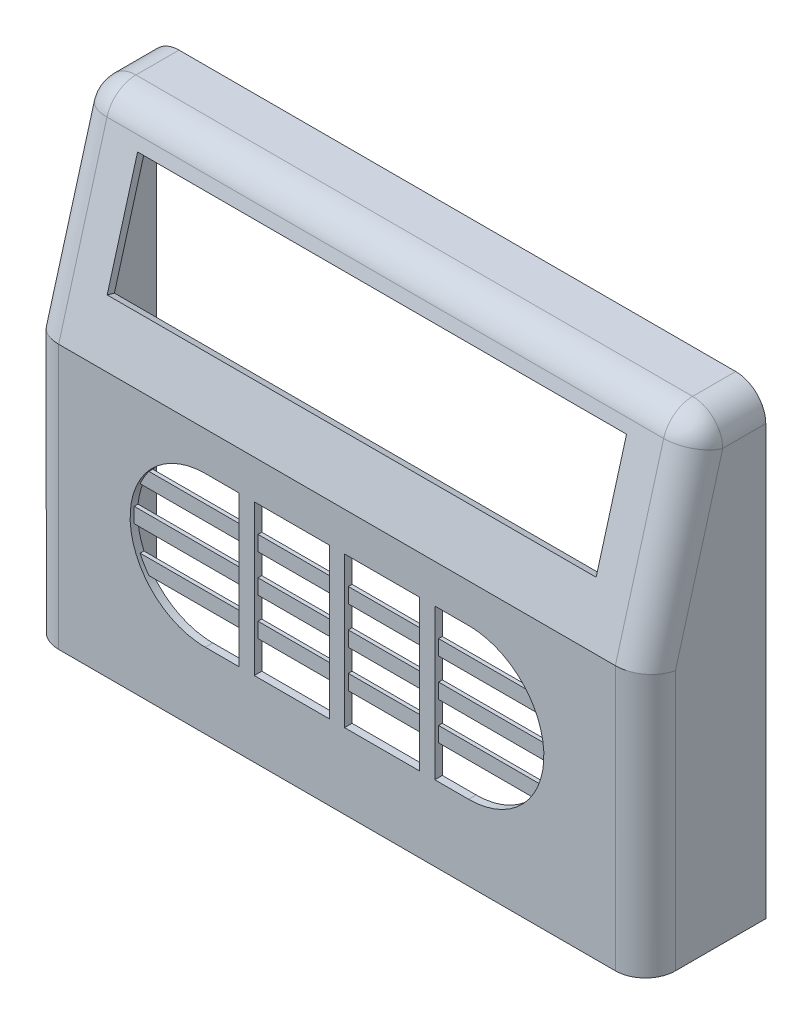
ISO-10303-21;
HEADER;
FILE_DESCRIPTION(('STEP AP214'),'2;1');
FILE_NAME('part.step','',(''),(''),'','','');
FILE_SCHEMA(('AUTOMOTIVE_DESIGN { 1 0 10303 214 1 1 1 1 }'));
ENDSEC;
DATA;
#1=APPLICATION_CONTEXT('core data for automotive mechanical design processes');
#2=APPLICATION_PROTOCOL_DEFINITION('international standard','automotive_design',2000,#1);
#3=PRODUCT_CONTEXT('',#1,'mechanical');
#4=PRODUCT('Part','Part','',(#3));
#5=PRODUCT_RELATED_PRODUCT_CATEGORY('part','',(#4));
#6=PRODUCT_DEFINITION_FORMATION('','',#4);
#7=PRODUCT_DEFINITION_CONTEXT('part definition',#1,'design');
#8=PRODUCT_DEFINITION('design','',#6,#7);
#9=PRODUCT_DEFINITION_SHAPE('','',#8);
#10=(LENGTH_UNIT() NAMED_UNIT(*) SI_UNIT(.MILLI.,.METRE.));
#11=(NAMED_UNIT(*) PLANE_ANGLE_UNIT() SI_UNIT($,.RADIAN.));
#12=(NAMED_UNIT(*) SI_UNIT($,.STERADIAN.) SOLID_ANGLE_UNIT());
#13=UNCERTAINTY_MEASURE_WITH_UNIT(LENGTH_MEASURE(1.E-05),#10,'distance_accuracy_value','');
#14=(GEOMETRIC_REPRESENTATION_CONTEXT(3) GLOBAL_UNCERTAINTY_ASSIGNED_CONTEXT((#13)) GLOBAL_UNIT_ASSIGNED_CONTEXT((#10,
#11,#12)) REPRESENTATION_CONTEXT('',''));
#15=CARTESIAN_POINT('',(0.,0.,0.));
#16=DIRECTION('',(0.,0.,1.));
#17=DIRECTION('',(1.,0.,0.));
#18=AXIS2_PLACEMENT_3D('',#15,#16,#17);
#19=CARTESIAN_POINT('',(40.,60.26962992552,8.96296401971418));
#20=DIRECTION('',(0.,-0.269629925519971,-0.962964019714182));
#21=DIRECTION('',(0.,0.962964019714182,-0.269629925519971));
#22=AXIS2_PLACEMENT_3D('',#19,#20,#21);
#23=PLANE('',#22);
#24=DIRECTION('',(1.,0.,0.));
#25=VECTOR('',#24,1.);
#26=CARTESIAN_POINT('',(40.,58.0785197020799,9.57647488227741));
#27=LINE('',#26,#25);
#28=CARTESIAN_POINT('',(37.,58.0785197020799,9.57647488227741));
#29=VERTEX_POINT('',#28);
#30=CARTESIAN_POINT('',(-37.,58.0785197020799,9.57647488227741));
#31=VERTEX_POINT('',#30);
#32=EDGE_CURVE('E1790',#29,#31,#27,.F.);
#33=ORIENTED_EDGE('',*,*,#32,.T.);
#34=DIRECTION('',(0.,0.962964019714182,-0.269629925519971));
#35=VECTOR('',#34,1.);
#36=CARTESIAN_POINT('',(-37.,60.26962992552,8.96296401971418));
#37=LINE('',#36,#35);
#38=CARTESIAN_POINT('',(-37.,35.1373585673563,16.));
#39=VERTEX_POINT('',#38);
#40=EDGE_CURVE('E1731',#31,#39,#37,.F.);
#41=ORIENTED_EDGE('',*,*,#40,.T.);
#42=DIRECTION('',(-1.,0.,0.));
#43=VECTOR('',#42,1.);
#44=CARTESIAN_POINT('',(40.,35.1373585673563,16.));
#45=LINE('',#44,#43);
#46=CARTESIAN_POINT('',(37.,35.1373585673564,16.));
#47=VERTEX_POINT('',#46);
#48=EDGE_CURVE('E1748',#47,#39,#45,.T.);
#49=ORIENTED_EDGE('',*,*,#48,.F.);
#50=DIRECTION('',(0.,0.962964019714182,-0.269629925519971));
#51=VECTOR('',#50,1.);
#52=CARTESIAN_POINT('',(37.,60.26962992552,8.96296401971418));
#53=LINE('',#52,#51);
#54=EDGE_CURVE('E1792',#47,#29,#53,.T.);
#55=ORIENTED_EDGE('',*,*,#54,.T.);
#56=EDGE_LOOP('',(#33,#41,#49,#55));
#57=FACE_BOUND('',#56,.T.);
#58=DIRECTION('',(0.,-0.962964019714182,0.269629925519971));
#59=VECTOR('',#58,1.);
#60=CARTESIAN_POINT('',(32.5,6.70879906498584,23.9599966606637));
#61=LINE('',#60,#59);
#62=CARTESIAN_POINT('',(32.5,56.5333328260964,10.0091272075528));
#63=VERTEX_POINT('',#62);
#64=CARTESIAN_POINT('',(32.5,42.0888725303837,14.0535760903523));
#65=VERTEX_POINT('',#64);
#66=EDGE_CURVE('E817',#63,#65,#61,.T.);
#67=ORIENTED_EDGE('',*,*,#66,.T.);
#68=DIRECTION('',(-1.,0.,0.));
#69=VECTOR('',#68,1.);
#70=CARTESIAN_POINT('',(0.,42.0888725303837,14.0535760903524));
#71=LINE('',#70,#69);
#72=CARTESIAN_POINT('',(-32.5,42.0888725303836,14.0535760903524));
#73=VERTEX_POINT('',#72);
#74=EDGE_CURVE('E829',#65,#73,#71,.T.);
#75=ORIENTED_EDGE('',*,*,#74,.T.);
#76=DIRECTION('',(0.,0.962964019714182,-0.269629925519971));
#77=VECTOR('',#76,1.);
#78=CARTESIAN_POINT('',(-32.5,6.70879906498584,23.9599966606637));
#79=LINE('',#78,#77);
#80=CARTESIAN_POINT('',(-32.5,56.5333328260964,10.0091272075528));
#81=VERTEX_POINT('',#80);
#82=EDGE_CURVE('E285',#73,#81,#79,.T.);
#83=ORIENTED_EDGE('',*,*,#82,.T.);
#84=DIRECTION('',(1.,0.,0.));
#85=VECTOR('',#84,1.);
#86=CARTESIAN_POINT('',(0.,56.5333328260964,10.0091272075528));
#87=LINE('',#86,#85);
#88=EDGE_CURVE('E847',#81,#63,#87,.T.);
#89=ORIENTED_EDGE('',*,*,#88,.T.);
#90=EDGE_LOOP('',(#67,#75,#83,#89));
#91=FACE_BOUND('',#90,.T.);
#92=ADVANCED_FACE('F266',(#57,#91),#23,.F.);
#93=CARTESIAN_POINT('',(40.,60.,8.));
#94=DIRECTION('',(0.,-0.269629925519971,-0.962964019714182));
#95=DIRECTION('',(0.,0.962964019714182,-0.269629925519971));
#96=AXIS2_PLACEMENT_3D('',#93,#94,#95);
#97=PLANE('',#96);
#98=DIRECTION('',(-1.,0.,0.));
#99=VECTOR('',#98,1.);
#100=CARTESIAN_POINT('',(40.,57.8088897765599,8.61351086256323));
#101=LINE('',#100,#99);
#102=CARTESIAN_POINT('',(37.,57.8088897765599,8.61351086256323));
#103=VERTEX_POINT('',#102);
#104=CARTESIAN_POINT('',(-37.,57.8088897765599,8.61351086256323));
#105=VERTEX_POINT('',#104);
#106=EDGE_CURVE('E1891',#103,#105,#101,.T.);
#107=ORIENTED_EDGE('',*,*,#106,.F.);
#108=DIRECTION('',(0.,-0.962964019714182,0.269629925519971));
#109=VECTOR('',#108,1.);
#110=CARTESIAN_POINT('',(37.,60.,8.));
#111=LINE('',#110,#109);
#112=CARTESIAN_POINT('',(37.,35.,15.));
#113=VERTEX_POINT('',#112);
#114=EDGE_CURVE('E1893',#113,#103,#111,.F.);
#115=ORIENTED_EDGE('',*,*,#114,.F.);
#116=DIRECTION('',(-1.,0.,0.));
#117=VECTOR('',#116,1.);
#118=CARTESIAN_POINT('',(40.,35.,15.));
#119=LINE('',#118,#117);
#120=CARTESIAN_POINT('',(-37.,35.,15.));
#121=VERTEX_POINT('',#120);
#122=EDGE_CURVE('E1912',#113,#121,#119,.T.);
#123=ORIENTED_EDGE('',*,*,#122,.T.);
#124=DIRECTION('',(0.,-0.962964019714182,0.269629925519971));
#125=VECTOR('',#124,1.);
#126=CARTESIAN_POINT('',(-37.,60.,8.));
#127=LINE('',#126,#125);
#128=EDGE_CURVE('E1889',#105,#121,#127,.T.);
#129=ORIENTED_EDGE('',*,*,#128,.F.);
#130=EDGE_LOOP('',(#107,#115,#123,#129));
#131=FACE_BOUND('',#130,.T.);
#132=DIRECTION('',(-1.,0.,0.));
#133=VECTOR('',#132,1.);
#134=CARTESIAN_POINT('',(0.,41.8192426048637,13.0906120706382));
#135=LINE('',#134,#133);
#136=CARTESIAN_POINT('',(32.5,41.8192426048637,13.0906120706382));
#137=VERTEX_POINT('',#136);
#138=CARTESIAN_POINT('',(-32.5,41.8192426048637,13.0906120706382));
#139=VERTEX_POINT('',#138);
#140=EDGE_CURVE('E834',#137,#139,#135,.T.);
#141=ORIENTED_EDGE('',*,*,#140,.F.);
#142=DIRECTION('',(0.,-0.962964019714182,0.269629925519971));
#143=VECTOR('',#142,1.);
#144=CARTESIAN_POINT('',(32.5,6.43916913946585,22.9970326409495));
#145=LINE('',#144,#143);
#146=CARTESIAN_POINT('',(32.5,56.2637029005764,9.04616318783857));
#147=VERTEX_POINT('',#146);
#148=EDGE_CURVE('E293',#147,#137,#145,.T.);
#149=ORIENTED_EDGE('',*,*,#148,.F.);
#150=DIRECTION('',(1.,0.,0.));
#151=VECTOR('',#150,1.);
#152=CARTESIAN_POINT('',(0.,56.2637029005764,9.04616318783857));
#153=LINE('',#152,#151);
#154=CARTESIAN_POINT('',(-32.5,56.2637029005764,9.04616318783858));
#155=VERTEX_POINT('',#154);
#156=EDGE_CURVE('E823',#155,#147,#153,.T.);
#157=ORIENTED_EDGE('',*,*,#156,.F.);
#158=DIRECTION('',(0.,0.962964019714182,-0.269629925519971));
#159=VECTOR('',#158,1.);
#160=CARTESIAN_POINT('',(-32.5,6.43916913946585,22.9970326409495));
#161=LINE('',#160,#159);
#162=EDGE_CURVE('E836',#139,#155,#161,.T.);
#163=ORIENTED_EDGE('',*,*,#162,.F.);
#164=EDGE_LOOP('',(#141,#149,#157,#163));
#165=FACE_BOUND('',#164,.T.);
#166=ADVANCED_FACE('F832',(#131,#165),#97,.T.);
#167=CARTESIAN_POINT('',(0.,10.0000000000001,-974.));
#168=DIRECTION('',(0.,-1.,0.));
#169=DIRECTION('',(0.,0.,-1.));
#170=AXIS2_PLACEMENT_3D('',#167,#168,#169);
#171=PLANE('',#170);
#172=DIRECTION('',(1.,0.,0.));
#173=VECTOR('',#172,1.);
#174=CARTESIAN_POINT('',(0.,10.,15.));
#175=LINE('',#174,#173);
#176=CARTESIAN_POINT('',(-11.,10.,15.));
#177=VERTEX_POINT('',#176);
#178=CARTESIAN_POINT('',(-1.00000000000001,10.,15.));
#179=VERTEX_POINT('',#178);
#180=EDGE_CURVE('E1436',#177,#179,#175,.T.);
#181=ORIENTED_EDGE('',*,*,#180,.F.);
#182=DIRECTION('',(0.,0.,-1.));
#183=VECTOR('',#182,1.);
#184=CARTESIAN_POINT('',(-11.,10.0000000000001,-974.));
#185=LINE('',#184,#183);
#186=CARTESIAN_POINT('',(-11.,10.,16.));
#187=VERTEX_POINT('',#186);
#188=EDGE_CURVE('E1209',#177,#187,#185,.F.);
#189=ORIENTED_EDGE('',*,*,#188,.T.);
#190=DIRECTION('',(1.,0.,0.));
#191=VECTOR('',#190,1.);
#192=CARTESIAN_POINT('',(0.,10.,16.));
#193=LINE('',#192,#191);
#194=CARTESIAN_POINT('',(-1.00000000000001,10.,16.));
#195=VERTEX_POINT('',#194);
#196=EDGE_CURVE('E2801',#187,#195,#193,.T.);
#197=ORIENTED_EDGE('',*,*,#196,.T.);
#198=DIRECTION('',(0.,0.,1.));
#199=VECTOR('',#198,1.);
#200=CARTESIAN_POINT('',(-1.00000000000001,10.0000000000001,-984.));
#201=LINE('',#200,#199);
#202=EDGE_CURVE('E1462',#179,#195,#201,.T.);
#203=ORIENTED_EDGE('',*,*,#202,.F.);
#204=EDGE_LOOP('',(#181,#189,#197,#203));
#205=FACE_BOUND('',#204,.T.);
#206=ADVANCED_FACE('F1669',(#205),#171,.F.);
#207=CARTESIAN_POINT('',(0.,30.0000000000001,-974.));
#208=DIRECTION('',(0.,1.,0.));
#209=DIRECTION('',(0.,0.,1.));
#210=AXIS2_PLACEMENT_3D('',#207,#208,#209);
#211=PLANE('',#210);
#212=DIRECTION('',(-1.,0.,0.));
#213=VECTOR('',#212,1.);
#214=CARTESIAN_POINT('',(0.,30.,16.));
#215=LINE('',#214,#213);
#216=CARTESIAN_POINT('',(-1.00000000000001,30.,16.));
#217=VERTEX_POINT('',#216);
#218=CARTESIAN_POINT('',(-11.,30.,16.));
#219=VERTEX_POINT('',#218);
#220=EDGE_CURVE('E1475',#217,#219,#215,.T.);
#221=ORIENTED_EDGE('',*,*,#220,.T.);
#222=DIRECTION('',(0.,0.,-1.));
#223=VECTOR('',#222,1.);
#224=CARTESIAN_POINT('',(-11.,30.0000000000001,-984.));
#225=LINE('',#224,#223);
#226=CARTESIAN_POINT('',(-11.,30.,15.));
#227=VERTEX_POINT('',#226);
#228=EDGE_CURVE('E1522',#227,#219,#225,.F.);
#229=ORIENTED_EDGE('',*,*,#228,.F.);
#230=DIRECTION('',(-1.,0.,0.));
#231=VECTOR('',#230,1.);
#232=CARTESIAN_POINT('',(0.,30.,15.));
#233=LINE('',#232,#231);
#234=CARTESIAN_POINT('',(-1.00000000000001,30.,15.));
#235=VERTEX_POINT('',#234);
#236=EDGE_CURVE('E1471',#235,#227,#233,.T.);
#237=ORIENTED_EDGE('',*,*,#236,.F.);
#238=DIRECTION('',(0.,0.,1.));
#239=VECTOR('',#238,1.);
#240=CARTESIAN_POINT('',(-1.00000000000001,30.0000000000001,-974.));
#241=LINE('',#240,#239);
#242=EDGE_CURVE('E1459',#235,#217,#241,.T.);
#243=ORIENTED_EDGE('',*,*,#242,.T.);
#244=EDGE_LOOP('',(#221,#229,#237,#243));
#245=FACE_BOUND('',#244,.T.);
#246=ADVANCED_FACE('F1520',(#245),#211,.F.);
#247=CARTESIAN_POINT('',(0.999999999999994,10.,15.));
#248=VERTEX_POINT('',#247);
#249=CARTESIAN_POINT('',(11.,10.,15.));
#250=VERTEX_POINT('',#249);
#251=EDGE_CURVE('E1428',#248,#250,#175,.T.);
#252=ORIENTED_EDGE('',*,*,#251,.F.);
#253=DIRECTION('',(0.,0.,-1.));
#254=VECTOR('',#253,1.);
#255=CARTESIAN_POINT('',(0.999999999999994,10.0000000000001,-974.));
#256=LINE('',#255,#254);
#257=CARTESIAN_POINT('',(0.999999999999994,10.,16.));
#258=VERTEX_POINT('',#257);
#259=EDGE_CURVE('E1224',#248,#258,#256,.F.);
#260=ORIENTED_EDGE('',*,*,#259,.T.);
#261=CARTESIAN_POINT('',(11.,10.,16.));
#262=VERTEX_POINT('',#261);
#263=EDGE_CURVE('E2763',#258,#262,#193,.T.);
#264=ORIENTED_EDGE('',*,*,#263,.T.);
#265=DIRECTION('',(0.,0.,1.));
#266=VECTOR('',#265,1.);
#267=CARTESIAN_POINT('',(11.,10.0000000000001,-984.));
#268=LINE('',#267,#266);
#269=EDGE_CURVE('E1452',#250,#262,#268,.T.);
#270=ORIENTED_EDGE('',*,*,#269,.F.);
#271=EDGE_LOOP('',(#252,#260,#264,#270));
#272=FACE_BOUND('',#271,.T.);
#273=ADVANCED_FACE('F2147',(#272),#171,.F.);
#274=CARTESIAN_POINT('',(11.,30.,16.));
#275=VERTEX_POINT('',#274);
#276=CARTESIAN_POINT('',(0.999999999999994,30.,16.));
#277=VERTEX_POINT('',#276);
#278=EDGE_CURVE('E1478',#275,#277,#215,.T.);
#279=ORIENTED_EDGE('',*,*,#278,.T.);
#280=DIRECTION('',(0.,0.,-1.));
#281=VECTOR('',#280,1.);
#282=CARTESIAN_POINT('',(0.999999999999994,30.0000000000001,-984.));
#283=LINE('',#282,#281);
#284=CARTESIAN_POINT('',(0.999999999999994,30.,15.));
#285=VERTEX_POINT('',#284);
#286=EDGE_CURVE('E1463',#285,#277,#283,.F.);
#287=ORIENTED_EDGE('',*,*,#286,.F.);
#288=CARTESIAN_POINT('',(11.,30.,15.));
#289=VERTEX_POINT('',#288);
#290=EDGE_CURVE('E1343',#289,#285,#233,.T.);
#291=ORIENTED_EDGE('',*,*,#290,.F.);
#292=DIRECTION('',(0.,0.,1.));
#293=VECTOR('',#292,1.);
#294=CARTESIAN_POINT('',(11.,30.0000000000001,-974.));
#295=LINE('',#294,#293);
#296=EDGE_CURVE('E1449',#289,#275,#295,.T.);
#297=ORIENTED_EDGE('',*,*,#296,.T.);
#298=EDGE_LOOP('',(#279,#287,#291,#297));
#299=FACE_BOUND('',#298,.T.);
#300=ADVANCED_FACE('F2156',(#299),#211,.F.);
#301=CARTESIAN_POINT('',(13.,10.,15.));
#302=VERTEX_POINT('',#301);
#303=CARTESIAN_POINT('',(17.5,10.,15.));
#304=VERTEX_POINT('',#303);
#305=EDGE_CURVE('E1437',#302,#304,#175,.T.);
#306=ORIENTED_EDGE('',*,*,#305,.F.);
#307=DIRECTION('',(0.,0.,-1.));
#308=VECTOR('',#307,1.);
#309=CARTESIAN_POINT('',(13.,10.0000000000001,-974.));
#310=LINE('',#309,#308);
#311=CARTESIAN_POINT('',(13.,10.,16.));
#312=VERTEX_POINT('',#311);
#313=EDGE_CURVE('E1239',#302,#312,#310,.F.);
#314=ORIENTED_EDGE('',*,*,#313,.T.);
#315=CARTESIAN_POINT('',(17.5,10.,16.));
#316=VERTEX_POINT('',#315);
#317=EDGE_CURVE('E1446',#312,#316,#193,.T.);
#318=ORIENTED_EDGE('',*,*,#317,.T.);
#319=CARTESIAN_POINT('',(17.5,10.,15.));
#320=DIRECTION('',(0.,0.,1.));
#321=VECTOR('',#320,1.);
#322=LINE('',#319,#321);
#323=EDGE_CURVE('E1335',#304,#316,#322,.T.);
#324=ORIENTED_EDGE('',*,*,#323,.F.);
#325=EDGE_LOOP('',(#306,#314,#318,#324));
#326=FACE_BOUND('',#325,.T.);
#327=ADVANCED_FACE('F1633',(#326),#171,.F.);
#328=CARTESIAN_POINT('',(17.5,30.,16.));
#329=VERTEX_POINT('',#328);
#330=CARTESIAN_POINT('',(13.,30.,16.));
#331=VERTEX_POINT('',#330);
#332=EDGE_CURVE('E1483',#329,#331,#215,.T.);
#333=ORIENTED_EDGE('',*,*,#332,.T.);
#334=DIRECTION('',(0.,0.,-1.));
#335=VECTOR('',#334,1.);
#336=CARTESIAN_POINT('',(13.,30.0000000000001,-984.));
#337=LINE('',#336,#335);
#338=CARTESIAN_POINT('',(13.,30.,15.));
#339=VERTEX_POINT('',#338);
#340=EDGE_CURVE('E1453',#339,#331,#337,.F.);
#341=ORIENTED_EDGE('',*,*,#340,.F.);
#342=CARTESIAN_POINT('',(17.5,30.,15.));
#343=VERTEX_POINT('',#342);
#344=EDGE_CURVE('E1501',#343,#339,#233,.T.);
#345=ORIENTED_EDGE('',*,*,#344,.F.);
#346=CARTESIAN_POINT('',(17.5,30.,16.));
#347=DIRECTION('',(0.,0.,-1.));
#348=VECTOR('',#347,1.);
#349=LINE('',#346,#348);
#350=EDGE_CURVE('E1472',#343,#329,#349,.F.);
#351=ORIENTED_EDGE('',*,*,#350,.T.);
#352=EDGE_LOOP('',(#333,#341,#345,#351));
#353=FACE_BOUND('',#352,.T.);
#354=ADVANCED_FACE('F1624',(#353),#211,.F.);
#355=CARTESIAN_POINT('',(40.,0.,0.));
#356=DIRECTION('',(0.,0.,1.));
#357=DIRECTION('',(1.,0.,0.));
#358=AXIS2_PLACEMENT_3D('',#355,#356,#357);
#359=PLANE('',#358);
#360=DIRECTION('',(0.,1.,0.));
#361=VECTOR('',#360,1.);
#362=CARTESIAN_POINT('',(-40.,0.,0.));
#363=LINE('',#362,#361);
#364=CARTESIAN_POINT('',(-40.,0.,0.));
#365=VERTEX_POINT('',#364);
#366=CARTESIAN_POINT('',(-40.,57.,0.));
#367=VERTEX_POINT('',#366);
#368=EDGE_CURVE('E1919',#365,#367,#363,.T.);
#369=ORIENTED_EDGE('',*,*,#368,.F.);
#370=DIRECTION('',(-1.,0.,0.));
#371=VECTOR('',#370,1.);
#372=CARTESIAN_POINT('',(40.,0.,0.));
#373=LINE('',#372,#371);
#374=CARTESIAN_POINT('',(-41.,0.,0.));
#375=VERTEX_POINT('',#374);
#376=EDGE_CURVE('E1747',#365,#375,#373,.T.);
#377=ORIENTED_EDGE('',*,*,#376,.T.);
#378=DIRECTION('',(0.,1.,0.));
#379=VECTOR('',#378,1.);
#380=CARTESIAN_POINT('',(-41.,0.,0.));
#381=LINE('',#380,#379);
#382=CARTESIAN_POINT('',(-41.,57.,0.));
#383=VERTEX_POINT('',#382);
#384=EDGE_CURVE('E1759',#375,#383,#381,.T.);
#385=ORIENTED_EDGE('',*,*,#384,.T.);
#386=CARTESIAN_POINT('',(-37.,57.,0.));
#387=DIRECTION('',(0.,0.,1.));
#388=DIRECTION('',(1.,0.,0.));
#389=AXIS2_PLACEMENT_3D('',#386,#387,#388);
#390=CIRCLE('',#389,4.);
#391=CARTESIAN_POINT('',(-37.,61.,0.));
#392=VERTEX_POINT('',#391);
#393=EDGE_CURVE('E1751',#383,#392,#390,.F.);
#394=ORIENTED_EDGE('',*,*,#393,.T.);
#395=DIRECTION('',(-1.,0.,0.));
#396=VECTOR('',#395,1.);
#397=CARTESIAN_POINT('',(40.,61.,0.));
#398=LINE('',#397,#396);
#399=CARTESIAN_POINT('',(37.,61.,0.));
#400=VERTEX_POINT('',#399);
#401=EDGE_CURVE('E1744',#400,#392,#398,.T.);
#402=ORIENTED_EDGE('',*,*,#401,.F.);
#403=CARTESIAN_POINT('',(37.,57.,0.));
#404=DIRECTION('',(0.,0.,1.));
#405=DIRECTION('',(1.,0.,0.));
#406=AXIS2_PLACEMENT_3D('',#403,#404,#405);
#407=CIRCLE('',#406,4.);
#408=CARTESIAN_POINT('',(41.,57.,0.));
#409=VERTEX_POINT('',#408);
#410=EDGE_CURVE('E1749',#400,#409,#407,.F.);
#411=ORIENTED_EDGE('',*,*,#410,.T.);
#412=DIRECTION('',(0.,1.,0.));
#413=VECTOR('',#412,1.);
#414=CARTESIAN_POINT('',(41.,0.,0.));
#415=LINE('',#414,#413);
#416=CARTESIAN_POINT('',(41.,0.,0.));
#417=VERTEX_POINT('',#416);
#418=EDGE_CURVE('E1753',#417,#409,#415,.T.);
#419=ORIENTED_EDGE('',*,*,#418,.F.);
#420=CARTESIAN_POINT('',(40.,0.,0.));
#421=VERTEX_POINT('',#420);
#422=EDGE_CURVE('E1789',#417,#421,#373,.T.);
#423=ORIENTED_EDGE('',*,*,#422,.T.);
#424=DIRECTION('',(0.,1.,0.));
#425=VECTOR('',#424,1.);
#426=CARTESIAN_POINT('',(40.,0.,0.));
#427=LINE('',#426,#425);
#428=CARTESIAN_POINT('',(40.,57.,0.));
#429=VERTEX_POINT('',#428);
#430=EDGE_CURVE('E1918',#421,#429,#427,.T.);
#431=ORIENTED_EDGE('',*,*,#430,.T.);
#432=CARTESIAN_POINT('',(37.,57.,0.));
#433=DIRECTION('',(0.,0.,1.));
#434=DIRECTION('',(1.,0.,0.));
#435=AXIS2_PLACEMENT_3D('',#432,#433,#434);
#436=CIRCLE('',#435,3.);
#437=CARTESIAN_POINT('',(37.,60.,0.));
#438=VERTEX_POINT('',#437);
#439=EDGE_CURVE('E1880',#438,#429,#436,.F.);
#440=ORIENTED_EDGE('',*,*,#439,.F.);
#441=DIRECTION('',(-1.,0.,0.));
#442=VECTOR('',#441,1.);
#443=CARTESIAN_POINT('',(40.,60.,0.));
#444=LINE('',#443,#442);
#445=CARTESIAN_POINT('',(-37.,60.,0.));
#446=VERTEX_POINT('',#445);
#447=EDGE_CURVE('E1909',#438,#446,#444,.T.);
#448=ORIENTED_EDGE('',*,*,#447,.T.);
#449=CARTESIAN_POINT('',(-37.,57.,0.));
#450=DIRECTION('',(0.,0.,1.));
#451=DIRECTION('',(1.,0.,0.));
#452=AXIS2_PLACEMENT_3D('',#449,#450,#451);
#453=CIRCLE('',#452,3.);
#454=EDGE_CURVE('E1878',#367,#446,#453,.F.);
#455=ORIENTED_EDGE('',*,*,#454,.F.);
#456=EDGE_LOOP('',(#369,#377,#385,#394,#402,#411,#419,#423,#431,#440,#448,#455));
#457=FACE_BOUND('',#456,.T.);
#458=ADVANCED_FACE('F1836',(#457),#359,.F.);
#459=CARTESIAN_POINT('',(40.,0.,15.));
#460=DIRECTION('',(0.,1.,0.));
#461=DIRECTION('',(0.,0.,1.));
#462=AXIS2_PLACEMENT_3D('',#459,#460,#461);
#463=PLANE('',#462);
#464=DIRECTION('',(0.,0.,-1.));
#465=VECTOR('',#464,1.);
#466=CARTESIAN_POINT('',(-40.,0.,15.));
#467=LINE('',#466,#465);
#468=CARTESIAN_POINT('',(-40.,0.,12.));
#469=VERTEX_POINT('',#468);
#470=EDGE_CURVE('E1851',#469,#365,#467,.T.);
#471=ORIENTED_EDGE('',*,*,#470,.F.);
#472=CARTESIAN_POINT('',(-37.,0.,12.));
#473=DIRECTION('',(0.,1.,0.));
#474=DIRECTION('',(0.,0.,1.));
#475=AXIS2_PLACEMENT_3D('',#472,#473,#474);
#476=CIRCLE('',#475,3.);
#477=CARTESIAN_POINT('',(-37.,0.,15.));
#478=VERTEX_POINT('',#477);
#479=EDGE_CURVE('E1901',#478,#469,#476,.F.);
#480=ORIENTED_EDGE('',*,*,#479,.F.);
#481=DIRECTION('',(-1.,0.,0.));
#482=VECTOR('',#481,1.);
#483=CARTESIAN_POINT('',(40.,0.,15.));
#484=LINE('',#483,#482);
#485=CARTESIAN_POINT('',(37.,0.,15.));
#486=VERTEX_POINT('',#485);
#487=EDGE_CURVE('E1915',#486,#478,#484,.T.);
#488=ORIENTED_EDGE('',*,*,#487,.F.);
#489=CARTESIAN_POINT('',(37.,0.,12.));
#490=DIRECTION('',(0.,1.,0.));
#491=DIRECTION('',(0.,0.,1.));
#492=AXIS2_PLACEMENT_3D('',#489,#490,#491);
#493=CIRCLE('',#492,3.);
#494=CARTESIAN_POINT('',(40.,0.,12.));
#495=VERTEX_POINT('',#494);
#496=EDGE_CURVE('E1903',#495,#486,#493,.F.);
#497=ORIENTED_EDGE('',*,*,#496,.F.);
#498=DIRECTION('',(0.,0.,-1.));
#499=VECTOR('',#498,1.);
#500=CARTESIAN_POINT('',(40.,0.,15.));
#501=LINE('',#500,#499);
#502=EDGE_CURVE('E1346',#495,#421,#501,.T.);
#503=ORIENTED_EDGE('',*,*,#502,.T.);
#504=ORIENTED_EDGE('',*,*,#422,.F.);
#505=DIRECTION('',(0.,0.,-1.));
#506=VECTOR('',#505,1.);
#507=CARTESIAN_POINT('',(41.,0.,15.));
#508=LINE('',#507,#506);
#509=CARTESIAN_POINT('',(41.,0.,12.));
#510=VERTEX_POINT('',#509);
#511=EDGE_CURVE('E1757',#510,#417,#508,.T.);
#512=ORIENTED_EDGE('',*,*,#511,.F.);
#513=CARTESIAN_POINT('',(37.,0.,12.));
#514=DIRECTION('',(0.,1.,0.));
#515=DIRECTION('',(0.,0.,1.));
#516=AXIS2_PLACEMENT_3D('',#513,#514,#515);
#517=CIRCLE('',#516,4.);
#518=CARTESIAN_POINT('',(37.,0.,16.));
#519=VERTEX_POINT('',#518);
#520=EDGE_CURVE('E1760',#510,#519,#517,.F.);
#521=ORIENTED_EDGE('',*,*,#520,.T.);
#522=DIRECTION('',(-1.,0.,0.));
#523=VECTOR('',#522,1.);
#524=CARTESIAN_POINT('',(40.,0.,16.));
#525=LINE('',#524,#523);
#526=CARTESIAN_POINT('',(-37.,0.,16.));
#527=VERTEX_POINT('',#526);
#528=EDGE_CURVE('E1756',#519,#527,#525,.T.);
#529=ORIENTED_EDGE('',*,*,#528,.T.);
#530=CARTESIAN_POINT('',(-37.,0.,12.));
#531=DIRECTION('',(0.,1.,0.));
#532=DIRECTION('',(0.,0.,1.));
#533=AXIS2_PLACEMENT_3D('',#530,#531,#532);
#534=CIRCLE('',#533,4.);
#535=CARTESIAN_POINT('',(-41.,0.,12.));
#536=VERTEX_POINT('',#535);
#537=EDGE_CURVE('E1762',#527,#536,#534,.F.);
#538=ORIENTED_EDGE('',*,*,#537,.T.);
#539=DIRECTION('',(0.,0.,-1.));
#540=VECTOR('',#539,1.);
#541=CARTESIAN_POINT('',(-41.,0.,15.));
#542=LINE('',#541,#540);
#543=EDGE_CURVE('E1768',#536,#375,#542,.T.);
#544=ORIENTED_EDGE('',*,*,#543,.T.);
#545=ORIENTED_EDGE('',*,*,#376,.F.);
#546=EDGE_LOOP('',(#471,#480,#488,#497,#503,#504,#512,#521,#529,#538,#544,#545));
#547=FACE_BOUND('',#546,.T.);
#548=ADVANCED_FACE('F1843',(#547),#463,.F.);
#549=CARTESIAN_POINT('',(40.,61.,0.));
#550=DIRECTION('',(0.,-1.,0.));
#551=DIRECTION('',(0.,0.,-1.));
#552=AXIS2_PLACEMENT_3D('',#549,#550,#551);
#553=PLANE('',#552);
#554=ORIENTED_EDGE('',*,*,#401,.T.);
#555=DIRECTION('',(0.,0.,-1.));
#556=VECTOR('',#555,1.);
#557=CARTESIAN_POINT('',(-37.,61.,0.));
#558=LINE('',#557,#556);
#559=CARTESIAN_POINT('',(-37.,61.,5.72461880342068));
#560=VERTEX_POINT('',#559);
#561=EDGE_CURVE('E1752',#392,#560,#558,.F.);
#562=ORIENTED_EDGE('',*,*,#561,.T.);
#563=DIRECTION('',(1.,0.,0.));
#564=VECTOR('',#563,1.);
#565=CARTESIAN_POINT('',(40.,61.,5.72461880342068));
#566=LINE('',#565,#564);
#567=CARTESIAN_POINT('',(37.,61.,5.72461880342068));
#568=VERTEX_POINT('',#567);
#569=EDGE_CURVE('E1817',#560,#568,#566,.T.);
#570=ORIENTED_EDGE('',*,*,#569,.T.);
#571=DIRECTION('',(0.,0.,-1.));
#572=VECTOR('',#571,1.);
#573=CARTESIAN_POINT('',(37.,61.,0.));
#574=LINE('',#573,#572);
#575=EDGE_CURVE('E1794',#568,#400,#574,.T.);
#576=ORIENTED_EDGE('',*,*,#575,.T.);
#577=EDGE_LOOP('',(#554,#562,#570,#576));
#578=FACE_BOUND('',#577,.T.);
#579=ADVANCED_FACE('F1675',(#578),#553,.F.);
#580=CARTESIAN_POINT('',(40.,35.,16.));
#581=DIRECTION('',(0.,0.,-1.));
#582=DIRECTION('',(0.,1.,0.));
#583=AXIS2_PLACEMENT_3D('',#580,#581,#582);
#584=PLANE('',#583);
#585=DIRECTION('',(0.,-1.,0.));
#586=VECTOR('',#585,1.);
#587=CARTESIAN_POINT('',(-13.,0.,16.));
#588=LINE('',#587,#586);
#589=CARTESIAN_POINT('',(-13.,30.,16.));
#590=VERTEX_POINT('',#589);
#591=CARTESIAN_POINT('',(-13.,10.,16.));
#592=VERTEX_POINT('',#591);
#593=EDGE_CURVE('E1206',#590,#592,#588,.T.);
#594=ORIENTED_EDGE('',*,*,#593,.T.);
#595=CARTESIAN_POINT('',(-17.5,10.,16.));
#596=VERTEX_POINT('',#595);
#597=EDGE_CURVE('E1629',#596,#592,#193,.T.);
#598=ORIENTED_EDGE('',*,*,#597,.F.);
#599=CARTESIAN_POINT('',(-17.5,30.,16.));
#600=CARTESIAN_POINT('',(-18.4846362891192,30.,16.));
#601=CARTESIAN_POINT('',(-19.4509032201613,29.8078528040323,16.));
#602=CARTESIAN_POINT('',(-20.4163635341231,29.6158660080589,16.));
#603=CARTESIAN_POINT('',(-21.3268343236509,29.2387953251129,16.));
#604=CARTESIAN_POINT('',(-22.2362888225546,28.862145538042,16.));
#605=CARTESIAN_POINT('',(-23.055702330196,28.3146961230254,16.));
#606=CARTESIAN_POINT('',(-23.8742011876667,27.7678577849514,16.));
#607=CARTESIAN_POINT('',(-24.5710678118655,27.0710678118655,16.));
#608=CARTESIAN_POINT('',(-25.2671565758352,26.3750556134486,16.));
#609=CARTESIAN_POINT('',(-25.8146961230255,25.555702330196,16.));
#610=CARTESIAN_POINT('',(-26.3616244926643,24.7372636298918,16.));
#611=CARTESIAN_POINT('',(-26.7387953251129,23.8268343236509,16.));
#612=CARTESIAN_POINT('',(-27.1155451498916,22.9174212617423,16.));
#613=CARTESIAN_POINT('',(-27.3078528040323,21.9509032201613,16.));
#614=CARTESIAN_POINT('',(-27.4999457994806,20.9854640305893,16.));
#615=CARTESIAN_POINT('',(-27.5,20.,16.));
#616=CARTESIAN_POINT('',(-27.5000541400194,19.0156359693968,16.));
#617=CARTESIAN_POINT('',(-27.3078528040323,18.0490967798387,16.));
#618=CARTESIAN_POINT('',(-27.1158660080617,17.0836364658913,16.));
#619=CARTESIAN_POINT('',(-26.7387953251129,16.1731656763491,16.));
#620=CARTESIAN_POINT('',(-26.3621455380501,15.2637111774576,16.));
#621=CARTESIAN_POINT('',(-25.8146961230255,14.444297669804,16.));
#622=CARTESIAN_POINT('',(-25.2678577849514,13.6257988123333,16.));
#623=CARTESIAN_POINT('',(-24.5710678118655,12.9289321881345,16.));
#624=CARTESIAN_POINT('',(-23.8750556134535,12.2328434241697,16.));
#625=CARTESIAN_POINT('',(-23.055702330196,11.6853038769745,16.));
#626=CARTESIAN_POINT('',(-22.2372636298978,11.1383755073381,16.));
#627=CARTESIAN_POINT('',(-21.3268343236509,10.7612046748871,16.));
#628=CARTESIAN_POINT('',(-20.4174212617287,10.3844548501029,16.));
#629=CARTESIAN_POINT('',(-19.4509032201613,10.1921471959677,16.));
#630=CARTESIAN_POINT('',(-18.4851916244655,10.,16.));
#631=CARTESIAN_POINT('',(-17.5,10.,16.));
#632=B_SPLINE_CURVE_WITH_KNOTS('',2,(#599,#600,#601,#602,#603,#604,#605,#606,#607,#608,#609,
#610,#611,#612,#613,#614,#615,#616,#617,#618,#619,#620,#621,#622,#623,#624,#625,#626,#627,#628,
#629,#630,#631),.UNSPECIFIED.,.F.,.F.,(3,2,2,2,2,2,2,2,2,2,2,2,2,2,2,2,3),(0.,0.0625,0.125,
0.1875,0.25,0.3125,0.375,0.4375,0.5,0.5625,0.625,0.6875,0.75,0.8125,0.875,0.9375,1.),.UNSPECIFIED.);
#633=CARTESIAN_POINT('',(-17.5,30.,16.));
#634=VERTEX_POINT('',#633);
#635=EDGE_CURVE('E1496',#634,#596,#632,.T.);
#636=ORIENTED_EDGE('',*,*,#635,.F.);
#637=EDGE_CURVE('E1231',#590,#634,#215,.T.);
#638=ORIENTED_EDGE('',*,*,#637,.F.);
#639=EDGE_LOOP('',(#594,#598,#636,#638));
#640=FACE_BOUND('',#639,.T.);
#641=DIRECTION('',(0.,-1.,0.));
#642=VECTOR('',#641,1.);
#643=CARTESIAN_POINT('',(-1.00000000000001,0.,16.));
#644=LINE('',#643,#642);
#645=EDGE_CURVE('E1221',#217,#195,#644,.T.);
#646=ORIENTED_EDGE('',*,*,#645,.T.);
#647=ORIENTED_EDGE('',*,*,#196,.F.);
#648=DIRECTION('',(0.,1.,0.));
#649=VECTOR('',#648,1.);
#650=CARTESIAN_POINT('',(-11.,0.,16.));
#651=LINE('',#650,#649);
#652=EDGE_CURVE('E1198',#187,#219,#651,.T.);
#653=ORIENTED_EDGE('',*,*,#652,.T.);
#654=ORIENTED_EDGE('',*,*,#220,.F.);
#655=EDGE_LOOP('',(#646,#647,#653,#654));
#656=FACE_BOUND('',#655,.T.);
#657=DIRECTION('',(0.,-1.,0.));
#658=VECTOR('',#657,1.);
#659=CARTESIAN_POINT('',(11.,0.,16.));
#660=LINE('',#659,#658);
#661=EDGE_CURVE('E1236',#275,#262,#660,.T.);
#662=ORIENTED_EDGE('',*,*,#661,.T.);
#663=ORIENTED_EDGE('',*,*,#263,.F.);
#664=DIRECTION('',(0.,1.,0.));
#665=VECTOR('',#664,1.);
#666=CARTESIAN_POINT('',(0.999999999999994,0.,16.));
#667=LINE('',#666,#665);
#668=EDGE_CURVE('E1201',#258,#277,#667,.T.);
#669=ORIENTED_EDGE('',*,*,#668,.T.);
#670=ORIENTED_EDGE('',*,*,#278,.F.);
#671=EDGE_LOOP('',(#662,#663,#669,#670));
#672=FACE_BOUND('',#671,.T.);
#673=CARTESIAN_POINT('',(17.5,10.,16.));
#674=CARTESIAN_POINT('',(18.4846362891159,10.,16.));
#675=CARTESIAN_POINT('',(19.4509032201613,10.1921471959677,16.));
#676=CARTESIAN_POINT('',(20.4163635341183,10.3841339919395,16.));
#677=CARTESIAN_POINT('',(21.3268343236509,10.7612046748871,16.));
#678=CARTESIAN_POINT('',(22.2362888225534,11.1378544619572,16.));
#679=CARTESIAN_POINT('',(23.055702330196,11.6853038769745,16.));
#680=CARTESIAN_POINT('',(23.8742011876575,12.2321422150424,16.));
#681=CARTESIAN_POINT('',(24.5710678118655,12.9289321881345,16.));
#682=CARTESIAN_POINT('',(25.2671565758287,13.6249443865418,16.));
#683=CARTESIAN_POINT('',(25.8146961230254,14.444297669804,16.));
#684=CARTESIAN_POINT('',(26.361624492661,15.2627363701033,16.));
#685=CARTESIAN_POINT('',(26.7387953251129,16.1731656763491,16.));
#686=CARTESIAN_POINT('',(27.1155451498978,17.0825787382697,16.));
#687=CARTESIAN_POINT('',(27.3078528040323,18.0490967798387,16.));
#688=CARTESIAN_POINT('',(27.4999457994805,19.0145359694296,16.));
#689=CARTESIAN_POINT('',(27.5,20.,16.));
#690=CARTESIAN_POINT('',(27.5000541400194,20.9843640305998,16.));
#691=CARTESIAN_POINT('',(27.3078528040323,21.9509032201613,16.));
#692=CARTESIAN_POINT('',(27.1158660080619,22.9163635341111,16.));
#693=CARTESIAN_POINT('',(26.7387953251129,23.8268343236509,16.));
#694=CARTESIAN_POINT('',(26.3621455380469,24.7362888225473,16.));
#695=CARTESIAN_POINT('',(25.8146961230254,25.555702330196,16.));
#696=CARTESIAN_POINT('',(25.2678577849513,26.3742011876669,16.));
#697=CARTESIAN_POINT('',(24.5710678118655,27.0710678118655,16.));
#698=CARTESIAN_POINT('',(23.8750556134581,27.7671565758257,16.));
#699=CARTESIAN_POINT('',(23.055702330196,28.3146961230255,16.));
#700=CARTESIAN_POINT('',(22.237263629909,28.861624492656,16.));
#701=CARTESIAN_POINT('',(21.3268343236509,29.2387953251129,16.));
#702=CARTESIAN_POINT('',(20.4174212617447,29.6155451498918,16.));
#703=CARTESIAN_POINT('',(19.4509032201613,29.8078528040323,16.));
#704=CARTESIAN_POINT('',(18.4851916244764,30.,16.));
#705=CARTESIAN_POINT('',(17.5,30.,16.));
#706=B_SPLINE_CURVE_WITH_KNOTS('',2,(#673,#674,#675,#676,#677,#678,#679,#680,#681,#682,#683,
#684,#685,#686,#687,#688,#689,#690,#691,#692,#693,#694,#695,#696,#697,#698,#699,#700,#701,#702,
#703,#704,#705),.UNSPECIFIED.,.F.,.F.,(3,2,2,2,2,2,2,2,2,2,2,2,2,2,2,2,3),(0.,0.0625,0.125,
0.1875,0.25,0.3125,0.375,0.4375,0.5,0.5625,0.625,0.6875,0.75,0.8125,0.875,0.9375,1.),.UNSPECIFIED.);
#707=EDGE_CURVE('E1445',#316,#329,#706,.T.);
#708=ORIENTED_EDGE('',*,*,#707,.F.);
#709=ORIENTED_EDGE('',*,*,#317,.F.);
#710=DIRECTION('',(0.,1.,0.));
#711=VECTOR('',#710,1.);
#712=CARTESIAN_POINT('',(13.,0.,16.));
#713=LINE('',#712,#711);
#714=EDGE_CURVE('E1216',#312,#331,#713,.T.);
#715=ORIENTED_EDGE('',*,*,#714,.T.);
#716=ORIENTED_EDGE('',*,*,#332,.F.);
#717=EDGE_LOOP('',(#708,#709,#715,#716));
#718=FACE_BOUND('',#717,.T.);
#719=ORIENTED_EDGE('',*,*,#48,.T.);
#720=DIRECTION('',(0.,1.,0.));
#721=VECTOR('',#720,1.);
#722=CARTESIAN_POINT('',(-37.,35.,16.));
#723=LINE('',#722,#721);
#724=EDGE_CURVE('E1763',#39,#527,#723,.F.);
#725=ORIENTED_EDGE('',*,*,#724,.T.);
#726=ORIENTED_EDGE('',*,*,#528,.F.);
#727=DIRECTION('',(0.,1.,0.));
#728=VECTOR('',#727,1.);
#729=CARTESIAN_POINT('',(37.,35.,16.));
#730=LINE('',#729,#728);
#731=EDGE_CURVE('E1787',#519,#47,#730,.T.);
#732=ORIENTED_EDGE('',*,*,#731,.T.);
#733=EDGE_LOOP('',(#719,#725,#726,#732));
#734=FACE_BOUND('',#733,.T.);
#735=ADVANCED_FACE('F1630',(#640,#656,#672,#718,#734),#584,.F.);
#736=CARTESIAN_POINT('',(41.,0.,0.));
#737=DIRECTION('',(1.,0.,0.));
#738=DIRECTION('',(0.,0.,-1.));
#739=AXIS2_PLACEMENT_3D('',#736,#737,#738);
#740=PLANE('',#739);
#741=ORIENTED_EDGE('',*,*,#418,.T.);
#742=DIRECTION('',(0.,0.,-1.));
#743=VECTOR('',#742,1.);
#744=CARTESIAN_POINT('',(41.,57.,0.));
#745=LINE('',#744,#743);
#746=CARTESIAN_POINT('',(41.,57.,5.72461880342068));
#747=VERTEX_POINT('',#746);
#748=EDGE_CURVE('E1534',#409,#747,#745,.F.);
#749=ORIENTED_EDGE('',*,*,#748,.T.);
#750=DIRECTION('',(0.,0.962964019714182,-0.269629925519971));
#751=VECTOR('',#750,1.);
#752=CARTESIAN_POINT('',(41.,5.63027936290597,20.108140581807));
#753=LINE('',#752,#751);
#754=CARTESIAN_POINT('',(41.,34.587924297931,12.));
#755=VERTEX_POINT('',#754);
#756=EDGE_CURVE('E1777',#747,#755,#753,.F.);
#757=ORIENTED_EDGE('',*,*,#756,.T.);
#758=DIRECTION('',(0.,1.,0.));
#759=VECTOR('',#758,1.);
#760=CARTESIAN_POINT('',(41.,0.,12.));
#761=LINE('',#760,#759);
#762=EDGE_CURVE('E1773',#755,#510,#761,.F.);
#763=ORIENTED_EDGE('',*,*,#762,.T.);
#764=ORIENTED_EDGE('',*,*,#511,.T.);
#765=EDGE_LOOP('',(#741,#749,#757,#763,#764));
#766=FACE_BOUND('',#765,.T.);
#767=ADVANCED_FACE('F1679',(#766),#740,.T.);
#768=CARTESIAN_POINT('',(-41.,0.,0.));
#769=DIRECTION('',(1.,0.,0.));
#770=DIRECTION('',(0.,0.,-1.));
#771=AXIS2_PLACEMENT_3D('',#768,#769,#770);
#772=PLANE('',#771);
#773=ORIENTED_EDGE('',*,*,#543,.F.);
#774=DIRECTION('',(0.,1.,0.));
#775=VECTOR('',#774,1.);
#776=CARTESIAN_POINT('',(-41.,0.,12.));
#777=LINE('',#776,#775);
#778=CARTESIAN_POINT('',(-41.,34.587924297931,12.));
#779=VERTEX_POINT('',#778);
#780=EDGE_CURVE('E1798',#536,#779,#777,.T.);
#781=ORIENTED_EDGE('',*,*,#780,.T.);
#782=DIRECTION('',(0.,-0.962964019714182,0.269629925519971));
#783=VECTOR('',#782,1.);
#784=CARTESIAN_POINT('',(-41.,59.1911102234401,5.11110794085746));
#785=LINE('',#784,#783);
#786=CARTESIAN_POINT('',(-41.,57.,5.72461880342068));
#787=VERTEX_POINT('',#786);
#788=EDGE_CURVE('E1729',#779,#787,#785,.F.);
#789=ORIENTED_EDGE('',*,*,#788,.T.);
#790=DIRECTION('',(0.,0.,-1.));
#791=VECTOR('',#790,1.);
#792=CARTESIAN_POINT('',(-41.,57.,0.));
#793=LINE('',#792,#791);
#794=EDGE_CURVE('E1767',#787,#383,#793,.T.);
#795=ORIENTED_EDGE('',*,*,#794,.T.);
#796=ORIENTED_EDGE('',*,*,#384,.F.);
#797=EDGE_LOOP('',(#773,#781,#789,#795,#796));
#798=FACE_BOUND('',#797,.T.);
#799=ADVANCED_FACE('F1683',(#798),#772,.F.);
#800=CARTESIAN_POINT('',(37.,0.,12.));
#801=DIRECTION('',(0.,1.,0.));
#802=DIRECTION('',(0.,0.,1.));
#803=AXIS2_PLACEMENT_3D('',#800,#801,#802);
#804=CYLINDRICAL_SURFACE('',#803,4.);
#805=ORIENTED_EDGE('',*,*,#520,.F.);
#806=ORIENTED_EDGE('',*,*,#762,.F.);
#807=CARTESIAN_POINT('',(37.,34.587924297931,12.));
#808=DIRECTION('',(0.,0.990697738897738,-0.136080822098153));
#809=DIRECTION('',(0.,-0.136080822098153,-0.990697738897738));
#810=AXIS2_PLACEMENT_3D('',#807,#808,#809);
#811=ELLIPSE('',#810,4.03755842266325,4.);
#812=EDGE_CURVE('E1771',#47,#755,#811,.T.);
#813=ORIENTED_EDGE('',*,*,#812,.F.);
#814=ORIENTED_EDGE('',*,*,#731,.F.);
#815=EDGE_LOOP('',(#805,#806,#813,#814));
#816=FACE_BOUND('',#815,.T.);
#817=ADVANCED_FACE('F1687',(#816),#804,.T.);
#818=CARTESIAN_POINT('',(37.,57.,0.));
#819=DIRECTION('',(0.,0.,-1.));
#820=DIRECTION('',(-1.,0.,0.));
#821=AXIS2_PLACEMENT_3D('',#818,#819,#820);
#822=CYLINDRICAL_SURFACE('',#821,4.);
#823=ORIENTED_EDGE('',*,*,#410,.F.);
#824=ORIENTED_EDGE('',*,*,#575,.F.);
#825=CARTESIAN_POINT('',(37.,57.,5.72461880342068));
#826=DIRECTION('',(0.,0.,1.));
#827=DIRECTION('',(1.,0.,0.));
#828=AXIS2_PLACEMENT_3D('',#825,#826,#827);
#829=CIRCLE('',#828,4.);
#830=EDGE_CURVE('E1786',#747,#568,#829,.T.);
#831=ORIENTED_EDGE('',*,*,#830,.F.);
#832=ORIENTED_EDGE('',*,*,#748,.F.);
#833=EDGE_LOOP('',(#823,#824,#831,#832));
#834=FACE_BOUND('',#833,.T.);
#835=ADVANCED_FACE('F1691',(#834),#822,.T.);
#836=CARTESIAN_POINT('',(37.,5.63027936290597,20.108140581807));
#837=DIRECTION('',(0.,0.962964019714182,-0.269629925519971));
#838=DIRECTION('',(0.,0.269629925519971,0.962964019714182));
#839=AXIS2_PLACEMENT_3D('',#836,#837,#838);
#840=CYLINDRICAL_SURFACE('',#839,4.);
#841=ORIENTED_EDGE('',*,*,#812,.T.);
#842=ORIENTED_EDGE('',*,*,#756,.F.);
#843=CARTESIAN_POINT('',(37.,57.,5.72461880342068));
#844=DIRECTION('',(0.,0.962964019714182,-0.269629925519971));
#845=DIRECTION('',(0.,0.269629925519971,0.962964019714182));
#846=AXIS2_PLACEMENT_3D('',#843,#844,#845);
#847=CIRCLE('',#846,4.);
#848=EDGE_CURVE('E1801',#29,#747,#847,.T.);
#849=ORIENTED_EDGE('',*,*,#848,.F.);
#850=ORIENTED_EDGE('',*,*,#54,.F.);
#851=EDGE_LOOP('',(#841,#842,#849,#850));
#852=FACE_BOUND('',#851,.T.);
#853=ADVANCED_FACE('F1695',(#852),#840,.T.);
#854=CARTESIAN_POINT('',(37.,57.,5.72461880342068));
#855=DIRECTION('',(0.,0.,1.));
#856=DIRECTION('',(1.,0.,0.));
#857=AXIS2_PLACEMENT_3D('',#854,#855,#856);
#858=SPHERICAL_SURFACE('',#857,4.);
#859=ORIENTED_EDGE('',*,*,#848,.T.);
#860=ORIENTED_EDGE('',*,*,#830,.T.);
#861=CARTESIAN_POINT('',(37.,57.,5.72461880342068));
#862=DIRECTION('',(-1.,0.,0.));
#863=DIRECTION('',(0.,0.,1.));
#864=AXIS2_PLACEMENT_3D('',#861,#862,#863);
#865=CIRCLE('',#864,4.);
#866=EDGE_CURVE('E1804',#29,#568,#865,.T.);
#867=ORIENTED_EDGE('',*,*,#866,.F.);
#868=EDGE_LOOP('',(#859,#860,#867));
#869=FACE_BOUND('',#868,.T.);
#870=ADVANCED_FACE('F1699',(#869),#858,.T.);
#871=CARTESIAN_POINT('',(-37.,57.,0.));
#872=DIRECTION('',(0.,0.,1.));
#873=DIRECTION('',(1.,0.,0.));
#874=AXIS2_PLACEMENT_3D('',#871,#872,#873);
#875=CYLINDRICAL_SURFACE('',#874,4.);
#876=ORIENTED_EDGE('',*,*,#393,.F.);
#877=ORIENTED_EDGE('',*,*,#794,.F.);
#878=CARTESIAN_POINT('',(-37.,57.,5.72461880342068));
#879=DIRECTION('',(0.,0.,1.));
#880=DIRECTION('',(1.,0.,0.));
#881=AXIS2_PLACEMENT_3D('',#878,#879,#880);
#882=CIRCLE('',#881,4.);
#883=EDGE_CURVE('E1737',#560,#787,#882,.T.);
#884=ORIENTED_EDGE('',*,*,#883,.F.);
#885=ORIENTED_EDGE('',*,*,#561,.F.);
#886=EDGE_LOOP('',(#876,#877,#884,#885));
#887=FACE_BOUND('',#886,.T.);
#888=ADVANCED_FACE('F1703',(#887),#875,.T.);
#889=CARTESIAN_POINT('',(40.,57.,5.72461880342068));
#890=DIRECTION('',(-1.,0.,0.));
#891=DIRECTION('',(0.,0.,1.));
#892=AXIS2_PLACEMENT_3D('',#889,#890,#891);
#893=CYLINDRICAL_SURFACE('',#892,4.);
#894=ORIENTED_EDGE('',*,*,#866,.T.);
#895=ORIENTED_EDGE('',*,*,#569,.F.);
#896=CARTESIAN_POINT('',(-37.,57.,5.72461880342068));
#897=DIRECTION('',(1.,0.,0.));
#898=DIRECTION('',(0.,1.,0.));
#899=AXIS2_PLACEMENT_3D('',#896,#897,#898);
#900=CIRCLE('',#899,4.);
#901=EDGE_CURVE('E1734',#31,#560,#900,.F.);
#902=ORIENTED_EDGE('',*,*,#901,.F.);
#903=ORIENTED_EDGE('',*,*,#32,.F.);
#904=EDGE_LOOP('',(#894,#895,#902,#903));
#905=FACE_BOUND('',#904,.T.);
#906=ADVANCED_FACE('F1707',(#905),#893,.T.);
#907=CARTESIAN_POINT('',(-37.,57.,5.72461880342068));
#908=DIRECTION('',(0.,0.,1.));
#909=DIRECTION('',(1.,0.,0.));
#910=AXIS2_PLACEMENT_3D('',#907,#908,#909);
#911=SPHERICAL_SURFACE('',#910,4.);
#912=ORIENTED_EDGE('',*,*,#901,.T.);
#913=ORIENTED_EDGE('',*,*,#883,.T.);
#914=CARTESIAN_POINT('',(-37.,57.,5.72461880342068));
#915=DIRECTION('',(0.,-0.962964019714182,0.269629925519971));
#916=DIRECTION('',(0.,-0.269629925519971,-0.962964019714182));
#917=AXIS2_PLACEMENT_3D('',#914,#915,#916);
#918=CIRCLE('',#917,4.);
#919=EDGE_CURVE('E1727',#31,#787,#918,.T.);
#920=ORIENTED_EDGE('',*,*,#919,.F.);
#921=EDGE_LOOP('',(#912,#913,#920));
#922=FACE_BOUND('',#921,.T.);
#923=ADVANCED_FACE('F1711',(#922),#911,.T.);
#924=CARTESIAN_POINT('',(-37.,59.1911102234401,5.11110794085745));
#925=DIRECTION('',(0.,-0.962964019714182,0.269629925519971));
#926=DIRECTION('',(0.,-0.269629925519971,-0.962964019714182));
#927=AXIS2_PLACEMENT_3D('',#924,#925,#926);
#928=CYLINDRICAL_SURFACE('',#927,4.);
#929=ORIENTED_EDGE('',*,*,#919,.T.);
#930=ORIENTED_EDGE('',*,*,#788,.F.);
#931=CARTESIAN_POINT('',(-37.,34.5879242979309,12.));
#932=DIRECTION('',(0.,-0.990697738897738,0.136080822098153));
#933=DIRECTION('',(0.,-0.136080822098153,-0.990697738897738));
#934=AXIS2_PLACEMENT_3D('',#931,#932,#933);
#935=ELLIPSE('',#934,4.03755842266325,4.);
#936=EDGE_CURVE('E1735',#39,#779,#935,.T.);
#937=ORIENTED_EDGE('',*,*,#936,.F.);
#938=ORIENTED_EDGE('',*,*,#40,.F.);
#939=EDGE_LOOP('',(#929,#930,#937,#938));
#940=FACE_BOUND('',#939,.T.);
#941=ADVANCED_FACE('F1714',(#940),#928,.T.);
#942=CARTESIAN_POINT('',(-37.,35.,12.));
#943=DIRECTION('',(0.,-1.,0.));
#944=DIRECTION('',(0.,0.,-1.));
#945=AXIS2_PLACEMENT_3D('',#942,#943,#944);
#946=CYLINDRICAL_SURFACE('',#945,4.);
#947=ORIENTED_EDGE('',*,*,#936,.T.);
#948=ORIENTED_EDGE('',*,*,#780,.F.);
#949=ORIENTED_EDGE('',*,*,#537,.F.);
#950=ORIENTED_EDGE('',*,*,#724,.F.);
#951=EDGE_LOOP('',(#947,#948,#949,#950));
#952=FACE_BOUND('',#951,.T.);
#953=ADVANCED_FACE('F268',(#952),#946,.T.);
#954=CARTESIAN_POINT('',(40.,60.,0.));
#955=DIRECTION('',(0.,-1.,0.));
#956=DIRECTION('',(0.,0.,-1.));
#957=AXIS2_PLACEMENT_3D('',#954,#955,#956);
#958=PLANE('',#957);
#959=ORIENTED_EDGE('',*,*,#447,.F.);
#960=DIRECTION('',(0.,0.,1.));
#961=VECTOR('',#960,1.);
#962=CARTESIAN_POINT('',(37.,60.,0.));
#963=LINE('',#962,#961);
#964=CARTESIAN_POINT('',(37.,60.,5.72461880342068));
#965=VERTEX_POINT('',#964);
#966=EDGE_CURVE('E1887',#965,#438,#963,.F.);
#967=ORIENTED_EDGE('',*,*,#966,.F.);
#968=DIRECTION('',(-1.,0.,0.));
#969=VECTOR('',#968,1.);
#970=CARTESIAN_POINT('',(40.,60.,5.72461880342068));
#971=LINE('',#970,#969);
#972=CARTESIAN_POINT('',(-37.,60.,5.72461880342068));
#973=VERTEX_POINT('',#972);
#974=EDGE_CURVE('E1885',#973,#965,#971,.F.);
#975=ORIENTED_EDGE('',*,*,#974,.F.);
#976=DIRECTION('',(0.,0.,1.));
#977=VECTOR('',#976,1.);
#978=CARTESIAN_POINT('',(-37.,60.,0.));
#979=LINE('',#978,#977);
#980=EDGE_CURVE('E1883',#446,#973,#979,.T.);
#981=ORIENTED_EDGE('',*,*,#980,.F.);
#982=EDGE_LOOP('',(#959,#967,#975,#981));
#983=FACE_BOUND('',#982,.T.);
#984=ADVANCED_FACE('F1721',(#983),#958,.T.);
#985=CARTESIAN_POINT('',(40.,35.,15.));
#986=DIRECTION('',(0.,0.,-1.));
#987=DIRECTION('',(0.,1.,0.));
#988=AXIS2_PLACEMENT_3D('',#985,#986,#987);
#989=PLANE('',#988);
#990=DIRECTION('',(0.,1.,0.));
#991=VECTOR('',#990,1.);
#992=CARTESIAN_POINT('',(-11.,0.,15.));
#993=LINE('',#992,#991);
#994=CARTESIAN_POINT('',(-11.,26.,15.));
#995=VERTEX_POINT('',#994);
#996=EDGE_CURVE('E1213',#995,#227,#993,.T.);
#997=ORIENTED_EDGE('',*,*,#996,.F.);
#998=DIRECTION('',(-1.,0.,0.));
#999=VECTOR('',#998,1.);
#1000=CARTESIAN_POINT('',(0.,26.,15.));
#1001=LINE('',#1000,#999);
#1002=CARTESIAN_POINT('',(-1.00000000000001,26.,15.));
#1003=VERTEX_POINT('',#1002);
#1004=EDGE_CURVE('E873',#1003,#995,#1001,.T.);
#1005=ORIENTED_EDGE('',*,*,#1004,.F.);
#1006=DIRECTION('',(0.,-1.,0.));
#1007=VECTOR('',#1006,1.);
#1008=CARTESIAN_POINT('',(-1.00000000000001,0.,15.));
#1009=LINE('',#1008,#1007);
#1010=EDGE_CURVE('E1214',#235,#1003,#1009,.T.);
#1011=ORIENTED_EDGE('',*,*,#1010,.F.);
#1012=ORIENTED_EDGE('',*,*,#236,.T.);
#1013=EDGE_LOOP('',(#997,#1005,#1011,#1012));
#1014=FACE_BOUND('',#1013,.T.);
#1015=DIRECTION('',(0.,1.,0.));
#1016=VECTOR('',#1015,1.);
#1017=CARTESIAN_POINT('',(0.999999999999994,0.,15.));
#1018=LINE('',#1017,#1016);
#1019=CARTESIAN_POINT('',(0.999999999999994,26.,15.));
#1020=VERTEX_POINT('',#1019);
#1021=EDGE_CURVE('E1228',#1020,#285,#1018,.T.);
#1022=ORIENTED_EDGE('',*,*,#1021,.F.);
#1023=CARTESIAN_POINT('',(11.,26.,15.));
#1024=VERTEX_POINT('',#1023);
#1025=EDGE_CURVE('E869',#1024,#1020,#1001,.T.);
#1026=ORIENTED_EDGE('',*,*,#1025,.F.);
#1027=DIRECTION('',(0.,-1.,0.));
#1028=VECTOR('',#1027,1.);
#1029=CARTESIAN_POINT('',(11.,0.,15.));
#1030=LINE('',#1029,#1028);
#1031=EDGE_CURVE('E1229',#289,#1024,#1030,.T.);
#1032=ORIENTED_EDGE('',*,*,#1031,.F.);
#1033=ORIENTED_EDGE('',*,*,#290,.T.);
#1034=EDGE_LOOP('',(#1022,#1026,#1032,#1033));
#1035=FACE_BOUND('',#1034,.T.);
#1036=DIRECTION('',(0.,1.,0.));
#1037=VECTOR('',#1036,1.);
#1038=CARTESIAN_POINT('',(13.,0.,15.));
#1039=LINE('',#1038,#1037);
#1040=CARTESIAN_POINT('',(13.,26.,15.));
#1041=VERTEX_POINT('',#1040);
#1042=EDGE_CURVE('E1243',#1041,#339,#1039,.T.);
#1043=ORIENTED_EDGE('',*,*,#1042,.F.);
#1044=CARTESIAN_POINT('',(25.5001055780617,26.,15.));
#1045=VERTEX_POINT('',#1044);
#1046=EDGE_CURVE('E868',#1045,#1041,#1001,.T.);
#1047=ORIENTED_EDGE('',*,*,#1046,.F.);
#1048=CARTESIAN_POINT('',(17.5,10.,15.));
#1049=CARTESIAN_POINT('',(18.4846362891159,10.,15.));
#1050=CARTESIAN_POINT('',(19.4509032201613,10.1921471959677,15.));
#1051=CARTESIAN_POINT('',(20.4163635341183,10.3841339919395,15.));
#1052=CARTESIAN_POINT('',(21.3268343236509,10.7612046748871,15.));
#1053=CARTESIAN_POINT('',(22.2362888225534,11.1378544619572,15.));
#1054=CARTESIAN_POINT('',(23.055702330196,11.6853038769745,15.));
#1055=CARTESIAN_POINT('',(23.8742011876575,12.2321422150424,15.));
#1056=CARTESIAN_POINT('',(24.5710678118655,12.9289321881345,15.));
#1057=CARTESIAN_POINT('',(25.2671565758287,13.6249443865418,15.));
#1058=CARTESIAN_POINT('',(25.8146961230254,14.444297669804,15.));
#1059=CARTESIAN_POINT('',(26.361624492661,15.2627363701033,15.));
#1060=CARTESIAN_POINT('',(26.7387953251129,16.1731656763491,15.));
#1061=CARTESIAN_POINT('',(27.1155451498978,17.0825787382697,15.));
#1062=CARTESIAN_POINT('',(27.3078528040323,18.0490967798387,15.));
#1063=CARTESIAN_POINT('',(27.4999457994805,19.0145359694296,15.));
#1064=CARTESIAN_POINT('',(27.5,20.,15.));
#1065=CARTESIAN_POINT('',(27.5000541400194,20.9843640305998,15.));
#1066=CARTESIAN_POINT('',(27.3078528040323,21.9509032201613,15.));
#1067=CARTESIAN_POINT('',(27.1158660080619,22.9163635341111,15.));
#1068=CARTESIAN_POINT('',(26.7387953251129,23.8268343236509,15.));
#1069=CARTESIAN_POINT('',(26.3621455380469,24.7362888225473,15.));
#1070=CARTESIAN_POINT('',(25.8146961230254,25.555702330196,15.));
#1071=CARTESIAN_POINT('',(25.2678577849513,26.3742011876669,15.));
#1072=CARTESIAN_POINT('',(24.5710678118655,27.0710678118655,15.));
#1073=CARTESIAN_POINT('',(23.8750556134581,27.7671565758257,15.));
#1074=CARTESIAN_POINT('',(23.055702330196,28.3146961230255,15.));
#1075=CARTESIAN_POINT('',(22.237263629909,28.861624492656,15.));
#1076=CARTESIAN_POINT('',(21.3268343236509,29.2387953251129,15.));
#1077=CARTESIAN_POINT('',(20.4174212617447,29.6155451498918,15.));
#1078=CARTESIAN_POINT('',(19.4509032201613,29.8078528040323,15.));
#1079=CARTESIAN_POINT('',(18.4851916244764,30.,15.));
#1080=CARTESIAN_POINT('',(17.5,30.,15.));
#1081=B_SPLINE_CURVE_WITH_KNOTS('',2,(#1048,#1049,#1050,#1051,#1052,#1053,#1054,#1055,#1056,
#1057,#1058,#1059,#1060,#1061,#1062,#1063,#1064,#1065,#1066,#1067,#1068,#1069,#1070,#1071,#1072,
#1073,#1074,#1075,#1076,#1077,#1078,#1079,#1080),.UNSPECIFIED.,.F.,.F.,(3,2,2,2,2,2,2,2,2,2,2,2,
2,2,2,2,3),(0.,0.0625,0.125,0.1875,0.25,0.3125,0.375,0.4375,0.5,0.5625,0.625,0.6875,0.75,0.8125,
0.875,0.9375,1.),.UNSPECIFIED.);
#1082=EDGE_CURVE('E1326',#1045,#343,#1081,.T.);
#1083=ORIENTED_EDGE('',*,*,#1082,.T.);
#1084=ORIENTED_EDGE('',*,*,#344,.T.);
#1085=EDGE_LOOP('',(#1043,#1047,#1083,#1084));
#1086=FACE_BOUND('',#1085,.T.);
#1087=CARTESIAN_POINT('',(11.,24.,15.));
#1088=VERTEX_POINT('',#1087);
#1089=CARTESIAN_POINT('',(11.,21.,15.));
#1090=VERTEX_POINT('',#1089);
#1091=EDGE_CURVE('E1232',#1088,#1090,#1030,.T.);
#1092=ORIENTED_EDGE('',*,*,#1091,.F.);
#1093=DIRECTION('',(1.,0.,0.));
#1094=VECTOR('',#1093,1.);
#1095=CARTESIAN_POINT('',(0.,24.,15.));
#1096=LINE('',#1095,#1094);
#1097=CARTESIAN_POINT('',(0.999999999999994,24.,15.));
#1098=VERTEX_POINT('',#1097);
#1099=EDGE_CURVE('E864',#1098,#1088,#1096,.T.);
#1100=ORIENTED_EDGE('',*,*,#1099,.F.);
#1101=CARTESIAN_POINT('',(0.999999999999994,21.,15.));
#1102=VERTEX_POINT('',#1101);
#1103=EDGE_CURVE('E2756',#1102,#1098,#1018,.T.);
#1104=ORIENTED_EDGE('',*,*,#1103,.F.);
#1105=DIRECTION('',(-1.,0.,0.));
#1106=VECTOR('',#1105,1.);
#1107=CARTESIAN_POINT('',(0.,21.,15.));
#1108=LINE('',#1107,#1106);
#1109=EDGE_CURVE('E985',#1090,#1102,#1108,.T.);
#1110=ORIENTED_EDGE('',*,*,#1109,.F.);
#1111=EDGE_LOOP('',(#1092,#1100,#1104,#1110));
#1112=FACE_BOUND('',#1111,.T.);
#1113=CARTESIAN_POINT('',(-1.00000000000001,24.,15.));
#1114=VERTEX_POINT('',#1113);
#1115=CARTESIAN_POINT('',(-1.00000000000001,21.,15.));
#1116=VERTEX_POINT('',#1115);
#1117=EDGE_CURVE('E1217',#1114,#1116,#1009,.T.);
#1118=ORIENTED_EDGE('',*,*,#1117,.F.);
#1119=CARTESIAN_POINT('',(-11.,24.,15.));
#1120=VERTEX_POINT('',#1119);
#1121=EDGE_CURVE('E862',#1120,#1114,#1096,.T.);
#1122=ORIENTED_EDGE('',*,*,#1121,.F.);
#1123=CARTESIAN_POINT('',(-11.,21.,15.));
#1124=VERTEX_POINT('',#1123);
#1125=EDGE_CURVE('E2692',#1124,#1120,#993,.T.);
#1126=ORIENTED_EDGE('',*,*,#1125,.F.);
#1127=EDGE_CURVE('E989',#1116,#1124,#1108,.T.);
#1128=ORIENTED_EDGE('',*,*,#1127,.F.);
#1129=EDGE_LOOP('',(#1118,#1122,#1126,#1128));
#1130=FACE_BOUND('',#1129,.T.);
#1131=DIRECTION('',(0.,-1.,0.));
#1132=VECTOR('',#1131,1.);
#1133=CARTESIAN_POINT('',(-13.,0.,15.));
#1134=LINE('',#1133,#1132);
#1135=CARTESIAN_POINT('',(-13.,24.,15.));
#1136=VERTEX_POINT('',#1135);
#1137=CARTESIAN_POINT('',(-13.,21.,15.));
#1138=VERTEX_POINT('',#1137);
#1139=EDGE_CURVE('E1202',#1136,#1138,#1134,.T.);
#1140=ORIENTED_EDGE('',*,*,#1139,.F.);
#1141=CARTESIAN_POINT('',(-26.6651583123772,24.0000000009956,15.));
#1142=VERTEX_POINT('',#1141);
#1143=EDGE_CURVE('E857',#1142,#1136,#1096,.T.);
#1144=ORIENTED_EDGE('',*,*,#1143,.F.);
#1145=CARTESIAN_POINT('',(-17.5,30.,15.));
#1146=CARTESIAN_POINT('',(-18.4846362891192,30.,15.));
#1147=CARTESIAN_POINT('',(-19.4509032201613,29.8078528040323,15.));
#1148=CARTESIAN_POINT('',(-20.4163635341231,29.6158660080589,15.));
#1149=CARTESIAN_POINT('',(-21.3268343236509,29.2387953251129,15.));
#1150=CARTESIAN_POINT('',(-22.2362888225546,28.862145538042,15.));
#1151=CARTESIAN_POINT('',(-23.055702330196,28.3146961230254,15.));
#1152=CARTESIAN_POINT('',(-23.8742011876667,27.7678577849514,15.));
#1153=CARTESIAN_POINT('',(-24.5710678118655,27.0710678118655,15.));
#1154=CARTESIAN_POINT('',(-25.2671565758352,26.3750556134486,15.));
#1155=CARTESIAN_POINT('',(-25.8146961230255,25.555702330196,15.));
#1156=CARTESIAN_POINT('',(-26.3616244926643,24.7372636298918,15.));
#1157=CARTESIAN_POINT('',(-26.7387953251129,23.8268343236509,15.));
#1158=CARTESIAN_POINT('',(-27.1155451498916,22.9174212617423,15.));
#1159=CARTESIAN_POINT('',(-27.3078528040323,21.9509032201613,15.));
#1160=CARTESIAN_POINT('',(-27.4999457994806,20.9854640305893,15.));
#1161=CARTESIAN_POINT('',(-27.5,20.,15.));
#1162=CARTESIAN_POINT('',(-27.5000541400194,19.0156359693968,15.));
#1163=CARTESIAN_POINT('',(-27.3078528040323,18.0490967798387,15.));
#1164=CARTESIAN_POINT('',(-27.1158660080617,17.0836364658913,15.));
#1165=CARTESIAN_POINT('',(-26.7387953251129,16.1731656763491,15.));
#1166=CARTESIAN_POINT('',(-26.3621455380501,15.2637111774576,15.));
#1167=CARTESIAN_POINT('',(-25.8146961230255,14.444297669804,15.));
#1168=CARTESIAN_POINT('',(-25.2678577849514,13.6257988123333,15.));
#1169=CARTESIAN_POINT('',(-24.5710678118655,12.9289321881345,15.));
#1170=CARTESIAN_POINT('',(-23.8750556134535,12.2328434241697,15.));
#1171=CARTESIAN_POINT('',(-23.055702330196,11.6853038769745,15.));
#1172=CARTESIAN_POINT('',(-22.2372636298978,11.1383755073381,15.));
#1173=CARTESIAN_POINT('',(-21.3268343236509,10.7612046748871,15.));
#1174=CARTESIAN_POINT('',(-20.4174212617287,10.3844548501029,15.));
#1175=CARTESIAN_POINT('',(-19.4509032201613,10.1921471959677,15.));
#1176=CARTESIAN_POINT('',(-18.4851916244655,10.,15.));
#1177=CARTESIAN_POINT('',(-17.5,10.,15.));
#1178=B_SPLINE_CURVE_WITH_KNOTS('',2,(#1145,#1146,#1147,#1148,#1149,#1150,#1151,#1152,#1153,
#1154,#1155,#1156,#1157,#1158,#1159,#1160,#1161,#1162,#1163,#1164,#1165,#1166,#1167,#1168,#1169,
#1170,#1171,#1172,#1173,#1174,#1175,#1176,#1177),.UNSPECIFIED.,.F.,.F.,(3,2,2,2,2,2,2,2,2,2,2,2,
2,2,2,2,3),(0.,0.0625,0.125,0.1875,0.25,0.3125,0.375,0.4375,0.5,0.5625,0.625,0.6875,0.75,0.8125,
0.875,0.9375,1.),.UNSPECIFIED.);
#1179=CARTESIAN_POINT('',(-27.4499918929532,21.,15.));
#1180=VERTEX_POINT('',#1179);
#1181=EDGE_CURVE('E1500',#1142,#1180,#1178,.T.);
#1182=ORIENTED_EDGE('',*,*,#1181,.T.);
#1183=EDGE_CURVE('E999',#1138,#1180,#1108,.T.);
#1184=ORIENTED_EDGE('',*,*,#1183,.F.);
#1185=EDGE_LOOP('',(#1140,#1144,#1182,#1184));
#1186=FACE_BOUND('',#1185,.T.);
#1187=CARTESIAN_POINT('',(27.449990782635,20.9999999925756,15.));
#1188=VERTEX_POINT('',#1187);
#1189=CARTESIAN_POINT('',(26.6651748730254,24.,15.));
#1190=VERTEX_POINT('',#1189);
#1191=EDGE_CURVE('E1334',#1188,#1190,#1081,.T.);
#1192=ORIENTED_EDGE('',*,*,#1191,.T.);
#1193=CARTESIAN_POINT('',(13.,24.,15.));
#1194=VERTEX_POINT('',#1193);
#1195=EDGE_CURVE('E866',#1194,#1190,#1096,.T.);
#1196=ORIENTED_EDGE('',*,*,#1195,.F.);
#1197=CARTESIAN_POINT('',(13.,21.,15.));
#1198=VERTEX_POINT('',#1197);
#1199=EDGE_CURVE('E1607',#1198,#1194,#1039,.T.);
#1200=ORIENTED_EDGE('',*,*,#1199,.F.);
#1201=EDGE_CURVE('E984',#1188,#1198,#1108,.T.);
#1202=ORIENTED_EDGE('',*,*,#1201,.F.);
#1203=EDGE_LOOP('',(#1192,#1196,#1200,#1202));
#1204=FACE_BOUND('',#1203,.T.);
#1205=CARTESIAN_POINT('',(-13.,26.,15.));
#1206=VERTEX_POINT('',#1205);
#1207=CARTESIAN_POINT('',(-25.5000812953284,26.,15.));
#1208=VERTEX_POINT('',#1207);
#1209=EDGE_CURVE('E883',#1206,#1208,#1001,.T.);
#1210=ORIENTED_EDGE('',*,*,#1209,.F.);
#1211=CARTESIAN_POINT('',(-13.,30.,15.));
#1212=VERTEX_POINT('',#1211);
#1213=EDGE_CURVE('E1199',#1212,#1206,#1134,.T.);
#1214=ORIENTED_EDGE('',*,*,#1213,.F.);
#1215=CARTESIAN_POINT('',(-17.5,30.,15.));
#1216=VERTEX_POINT('',#1215);
#1217=EDGE_CURVE('E1469',#1212,#1216,#233,.T.);
#1218=ORIENTED_EDGE('',*,*,#1217,.T.);
#1219=EDGE_CURVE('E1498',#1216,#1208,#1178,.T.);
#1220=ORIENTED_EDGE('',*,*,#1219,.T.);
#1221=EDGE_LOOP('',(#1210,#1214,#1218,#1220));
#1222=FACE_BOUND('',#1221,.T.);
#1223=CARTESIAN_POINT('',(11.,19.,15.));
#1224=VERTEX_POINT('',#1223);
#1225=CARTESIAN_POINT('',(11.,16.,15.));
#1226=VERTEX_POINT('',#1225);
#1227=EDGE_CURVE('E2749',#1224,#1226,#1030,.T.);
#1228=ORIENTED_EDGE('',*,*,#1227,.F.);
#1229=DIRECTION('',(1.,0.,0.));
#1230=VECTOR('',#1229,1.);
#1231=CARTESIAN_POINT('',(0.,19.,15.));
#1232=LINE('',#1231,#1230);
#1233=CARTESIAN_POINT('',(0.999999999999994,19.,15.));
#1234=VERTEX_POINT('',#1233);
#1235=EDGE_CURVE('E980',#1234,#1224,#1232,.T.);
#1236=ORIENTED_EDGE('',*,*,#1235,.F.);
#1237=CARTESIAN_POINT('',(0.999999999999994,16.,15.));
#1238=VERTEX_POINT('',#1237);
#1239=EDGE_CURVE('E1227',#1238,#1234,#1018,.T.);
#1240=ORIENTED_EDGE('',*,*,#1239,.F.);
#1241=DIRECTION('',(-1.,0.,0.));
#1242=VECTOR('',#1241,1.);
#1243=CARTESIAN_POINT('',(0.,16.,15.));
#1244=LINE('',#1243,#1242);
#1245=EDGE_CURVE('E1102',#1226,#1238,#1244,.T.);
#1246=ORIENTED_EDGE('',*,*,#1245,.F.);
#1247=EDGE_LOOP('',(#1228,#1236,#1240,#1246));
#1248=FACE_BOUND('',#1247,.T.);
#1249=CARTESIAN_POINT('',(-1.00000000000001,19.,15.));
#1250=VERTEX_POINT('',#1249);
#1251=CARTESIAN_POINT('',(-1.00000000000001,16.,15.));
#1252=VERTEX_POINT('',#1251);
#1253=EDGE_CURVE('E2683',#1250,#1252,#1009,.T.);
#1254=ORIENTED_EDGE('',*,*,#1253,.F.);
#1255=CARTESIAN_POINT('',(-11.,19.,15.));
#1256=VERTEX_POINT('',#1255);
#1257=EDGE_CURVE('E978',#1256,#1250,#1232,.T.);
#1258=ORIENTED_EDGE('',*,*,#1257,.F.);
#1259=CARTESIAN_POINT('',(-11.,16.,15.));
#1260=VERTEX_POINT('',#1259);
#1261=EDGE_CURVE('E1212',#1260,#1256,#993,.T.);
#1262=ORIENTED_EDGE('',*,*,#1261,.F.);
#1263=EDGE_CURVE('E1106',#1252,#1260,#1244,.T.);
#1264=ORIENTED_EDGE('',*,*,#1263,.F.);
#1265=EDGE_LOOP('',(#1254,#1258,#1262,#1264));
#1266=FACE_BOUND('',#1265,.T.);
#1267=CARTESIAN_POINT('',(-13.,19.,15.));
#1268=VERTEX_POINT('',#1267);
#1269=CARTESIAN_POINT('',(-13.,16.,15.));
#1270=VERTEX_POINT('',#1269);
#1271=EDGE_CURVE('E2674',#1268,#1270,#1134,.T.);
#1272=ORIENTED_EDGE('',*,*,#1271,.F.);
#1273=CARTESIAN_POINT('',(-27.4499907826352,19.0000000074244,15.));
#1274=VERTEX_POINT('',#1273);
#1275=EDGE_CURVE('E973',#1274,#1268,#1232,.T.);
#1276=ORIENTED_EDGE('',*,*,#1275,.F.);
#1277=CARTESIAN_POINT('',(-26.6651748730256,16.,15.));
#1278=VERTEX_POINT('',#1277);
#1279=EDGE_CURVE('E1540',#1274,#1278,#1178,.T.);
#1280=ORIENTED_EDGE('',*,*,#1279,.T.);
#1281=EDGE_CURVE('E1116',#1270,#1278,#1244,.T.);
#1282=ORIENTED_EDGE('',*,*,#1281,.F.);
#1283=EDGE_LOOP('',(#1272,#1276,#1280,#1282));
#1284=FACE_BOUND('',#1283,.T.);
#1285=CARTESIAN_POINT('',(26.665158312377,15.9999999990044,15.));
#1286=VERTEX_POINT('',#1285);
#1287=CARTESIAN_POINT('',(27.4499918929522,19.,15.));
#1288=VERTEX_POINT('',#1287);
#1289=EDGE_CURVE('E1356',#1286,#1288,#1081,.T.);
#1290=ORIENTED_EDGE('',*,*,#1289,.T.);
#1291=CARTESIAN_POINT('',(13.,19.,15.));
#1292=VERTEX_POINT('',#1291);
#1293=EDGE_CURVE('E982',#1292,#1288,#1232,.T.);
#1294=ORIENTED_EDGE('',*,*,#1293,.F.);
#1295=CARTESIAN_POINT('',(13.,16.,15.));
#1296=VERTEX_POINT('',#1295);
#1297=EDGE_CURVE('E1242',#1296,#1292,#1039,.T.);
#1298=ORIENTED_EDGE('',*,*,#1297,.F.);
#1299=EDGE_CURVE('E1101',#1286,#1296,#1244,.T.);
#1300=ORIENTED_EDGE('',*,*,#1299,.F.);
#1301=EDGE_LOOP('',(#1290,#1294,#1298,#1300));
#1302=FACE_BOUND('',#1301,.T.);
#1303=CARTESIAN_POINT('',(11.,14.,15.));
#1304=VERTEX_POINT('',#1303);
#1305=EDGE_CURVE('E1233',#1304,#250,#1030,.T.);
#1306=ORIENTED_EDGE('',*,*,#1305,.F.);
#1307=DIRECTION('',(1.,0.,0.));
#1308=VECTOR('',#1307,1.);
#1309=CARTESIAN_POINT('',(0.,14.,15.));
#1310=LINE('',#1309,#1308);
#1311=CARTESIAN_POINT('',(0.999999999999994,14.,15.));
#1312=VERTEX_POINT('',#1311);
#1313=EDGE_CURVE('E1097',#1312,#1304,#1310,.T.);
#1314=ORIENTED_EDGE('',*,*,#1313,.F.);
#1315=EDGE_CURVE('E1225',#248,#1312,#1018,.T.);
#1316=ORIENTED_EDGE('',*,*,#1315,.F.);
#1317=ORIENTED_EDGE('',*,*,#251,.T.);
#1318=EDGE_LOOP('',(#1306,#1314,#1316,#1317));
#1319=FACE_BOUND('',#1318,.T.);
#1320=CARTESIAN_POINT('',(-1.00000000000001,14.,15.));
#1321=VERTEX_POINT('',#1320);
#1322=EDGE_CURVE('E1218',#1321,#179,#1009,.T.);
#1323=ORIENTED_EDGE('',*,*,#1322,.F.);
#1324=CARTESIAN_POINT('',(-11.,14.,15.));
#1325=VERTEX_POINT('',#1324);
#1326=EDGE_CURVE('E1095',#1325,#1321,#1310,.T.);
#1327=ORIENTED_EDGE('',*,*,#1326,.F.);
#1328=EDGE_CURVE('E1210',#177,#1325,#993,.T.);
#1329=ORIENTED_EDGE('',*,*,#1328,.F.);
#1330=ORIENTED_EDGE('',*,*,#180,.T.);
#1331=EDGE_LOOP('',(#1323,#1327,#1329,#1330));
#1332=FACE_BOUND('',#1331,.T.);
#1333=CARTESIAN_POINT('',(-13.,14.,15.));
#1334=VERTEX_POINT('',#1333);
#1335=CARTESIAN_POINT('',(-13.,10.,15.));
#1336=VERTEX_POINT('',#1335);
#1337=EDGE_CURVE('E1203',#1334,#1336,#1134,.T.);
#1338=ORIENTED_EDGE('',*,*,#1337,.F.);
#1339=CARTESIAN_POINT('',(-25.5001055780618,14.,15.));
#1340=VERTEX_POINT('',#1339);
#1341=EDGE_CURVE('E1090',#1340,#1334,#1310,.T.);
#1342=ORIENTED_EDGE('',*,*,#1341,.F.);
#1343=CARTESIAN_POINT('',(-17.5,10.,15.));
#1344=VERTEX_POINT('',#1343);
#1345=EDGE_CURVE('E1505',#1340,#1344,#1178,.T.);
#1346=ORIENTED_EDGE('',*,*,#1345,.T.);
#1347=EDGE_CURVE('E1416',#1344,#1336,#175,.T.);
#1348=ORIENTED_EDGE('',*,*,#1347,.T.);
#1349=EDGE_LOOP('',(#1338,#1342,#1346,#1348));
#1350=FACE_BOUND('',#1349,.T.);
#1351=CARTESIAN_POINT('',(25.5000812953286,14.,15.));
#1352=VERTEX_POINT('',#1351);
#1353=EDGE_CURVE('E1353',#304,#1352,#1081,.T.);
#1354=ORIENTED_EDGE('',*,*,#1353,.T.);
#1355=CARTESIAN_POINT('',(13.,14.,15.));
#1356=VERTEX_POINT('',#1355);
#1357=EDGE_CURVE('E1099',#1356,#1352,#1310,.T.);
#1358=ORIENTED_EDGE('',*,*,#1357,.F.);
#1359=EDGE_CURVE('E1240',#302,#1356,#1039,.T.);
#1360=ORIENTED_EDGE('',*,*,#1359,.F.);
#1361=ORIENTED_EDGE('',*,*,#305,.T.);
#1362=EDGE_LOOP('',(#1354,#1358,#1360,#1361));
#1363=FACE_BOUND('',#1362,.T.);
#1364=ORIENTED_EDGE('',*,*,#122,.F.);
#1365=DIRECTION('',(0.,-1.,0.));
#1366=VECTOR('',#1365,1.);
#1367=CARTESIAN_POINT('',(37.,35.,15.));
#1368=LINE('',#1367,#1366);
#1369=EDGE_CURVE('E1907',#486,#113,#1368,.F.);
#1370=ORIENTED_EDGE('',*,*,#1369,.F.);
#1371=ORIENTED_EDGE('',*,*,#487,.T.);
#1372=DIRECTION('',(0.,-1.,0.));
#1373=VECTOR('',#1372,1.);
#1374=CARTESIAN_POINT('',(-37.,35.,15.));
#1375=LINE('',#1374,#1373);
#1376=EDGE_CURVE('E1905',#121,#478,#1375,.T.);
#1377=ORIENTED_EDGE('',*,*,#1376,.F.);
#1378=EDGE_LOOP('',(#1364,#1370,#1371,#1377));
#1379=FACE_BOUND('',#1378,.T.);
#1380=ADVANCED_FACE('F1514',(#1014,#1035,#1086,#1112,#1130,#1186,#1204,#1222,#1248,#1266,#1284,
#1302,#1319,#1332,#1350,#1363,#1379),#989,.T.);
#1381=CARTESIAN_POINT('',(40.,0.,0.));
#1382=DIRECTION('',(1.,0.,0.));
#1383=DIRECTION('',(0.,0.,-1.));
#1384=AXIS2_PLACEMENT_3D('',#1381,#1382,#1383);
#1385=PLANE('',#1384);
#1386=ORIENTED_EDGE('',*,*,#430,.F.);
#1387=ORIENTED_EDGE('',*,*,#502,.F.);
#1388=DIRECTION('',(0.,-1.,0.));
#1389=VECTOR('',#1388,1.);
#1390=CARTESIAN_POINT('',(40.,0.,12.));
#1391=LINE('',#1390,#1389);
#1392=CARTESIAN_POINT('',(40.,34.587924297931,12.));
#1393=VERTEX_POINT('',#1392);
#1394=EDGE_CURVE('E1876',#1393,#495,#1391,.T.);
#1395=ORIENTED_EDGE('',*,*,#1394,.F.);
#1396=DIRECTION('',(0.,-0.962964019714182,0.269629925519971));
#1397=VECTOR('',#1396,1.);
#1398=CARTESIAN_POINT('',(40.,34.1911102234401,12.1111079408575));
#1399=LINE('',#1398,#1397);
#1400=CARTESIAN_POINT('',(40.,57.,5.72461880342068));
#1401=VERTEX_POINT('',#1400);
#1402=EDGE_CURVE('E1874',#1401,#1393,#1399,.T.);
#1403=ORIENTED_EDGE('',*,*,#1402,.F.);
#1404=DIRECTION('',(0.,0.,1.));
#1405=VECTOR('',#1404,1.);
#1406=CARTESIAN_POINT('',(40.,57.,8.));
#1407=LINE('',#1406,#1405);
#1408=EDGE_CURVE('E1739',#429,#1401,#1407,.T.);
#1409=ORIENTED_EDGE('',*,*,#1408,.F.);
#1410=EDGE_LOOP('',(#1386,#1387,#1395,#1403,#1409));
#1411=FACE_BOUND('',#1410,.T.);
#1412=ADVANCED_FACE('F1924',(#1411),#1385,.F.);
#1413=CARTESIAN_POINT('',(-40.,0.,0.));
#1414=DIRECTION('',(1.,0.,0.));
#1415=DIRECTION('',(0.,0.,-1.));
#1416=AXIS2_PLACEMENT_3D('',#1413,#1414,#1415);
#1417=PLANE('',#1416);
#1418=ORIENTED_EDGE('',*,*,#470,.T.);
#1419=ORIENTED_EDGE('',*,*,#368,.T.);
#1420=DIRECTION('',(0.,0.,1.));
#1421=VECTOR('',#1420,1.);
#1422=CARTESIAN_POINT('',(-40.,57.,0.));
#1423=LINE('',#1422,#1421);
#1424=CARTESIAN_POINT('',(-40.,57.,5.72461880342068));
#1425=VERTEX_POINT('',#1424);
#1426=EDGE_CURVE('E1899',#1425,#367,#1423,.F.);
#1427=ORIENTED_EDGE('',*,*,#1426,.F.);
#1428=DIRECTION('',(0.,-0.962964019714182,0.269629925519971));
#1429=VECTOR('',#1428,1.);
#1430=CARTESIAN_POINT('',(-40.,5.63027936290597,20.108140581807));
#1431=LINE('',#1430,#1429);
#1432=CARTESIAN_POINT('',(-40.,34.587924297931,12.));
#1433=VERTEX_POINT('',#1432);
#1434=EDGE_CURVE('E1897',#1433,#1425,#1431,.F.);
#1435=ORIENTED_EDGE('',*,*,#1434,.F.);
#1436=DIRECTION('',(0.,-1.,0.));
#1437=VECTOR('',#1436,1.);
#1438=CARTESIAN_POINT('',(-40.,0.,12.));
#1439=LINE('',#1438,#1437);
#1440=EDGE_CURVE('E1895',#469,#1433,#1439,.F.);
#1441=ORIENTED_EDGE('',*,*,#1440,.F.);
#1442=EDGE_LOOP('',(#1418,#1419,#1427,#1435,#1441));
#1443=FACE_BOUND('',#1442,.T.);
#1444=ADVANCED_FACE('F1943',(#1443),#1417,.T.);
#1445=CARTESIAN_POINT('',(37.,0.,12.));
#1446=DIRECTION('',(0.,1.,0.));
#1447=DIRECTION('',(0.,0.,1.));
#1448=AXIS2_PLACEMENT_3D('',#1445,#1446,#1447);
#1449=CYLINDRICAL_SURFACE('',#1448,3.);
#1450=ORIENTED_EDGE('',*,*,#496,.T.);
#1451=ORIENTED_EDGE('',*,*,#1369,.T.);
#1452=CARTESIAN_POINT('',(37.,34.587924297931,12.));
#1453=DIRECTION('',(0.,0.990697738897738,-0.136080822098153));
#1454=DIRECTION('',(0.,0.136080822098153,0.990697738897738));
#1455=AXIS2_PLACEMENT_3D('',#1452,#1453,#1454);
#1456=ELLIPSE('',#1455,3.02816881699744,3.);
#1457=EDGE_CURVE('E1848',#113,#1393,#1456,.T.);
#1458=ORIENTED_EDGE('',*,*,#1457,.T.);
#1459=ORIENTED_EDGE('',*,*,#1394,.T.);
#1460=EDGE_LOOP('',(#1450,#1451,#1458,#1459));
#1461=FACE_BOUND('',#1460,.T.);
#1462=ADVANCED_FACE('F1959',(#1461),#1449,.F.);
#1463=CARTESIAN_POINT('',(37.,57.,0.));
#1464=DIRECTION('',(0.,0.,-1.));
#1465=DIRECTION('',(-1.,0.,0.));
#1466=AXIS2_PLACEMENT_3D('',#1463,#1464,#1465);
#1467=CYLINDRICAL_SURFACE('',#1466,3.);
#1468=ORIENTED_EDGE('',*,*,#439,.T.);
#1469=ORIENTED_EDGE('',*,*,#1408,.T.);
#1470=CARTESIAN_POINT('',(37.,57.,5.72461880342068));
#1471=DIRECTION('',(0.,0.,1.));
#1472=DIRECTION('',(0.,-1.,0.));
#1473=AXIS2_PLACEMENT_3D('',#1470,#1471,#1472);
#1474=CIRCLE('',#1473,3.);
#1475=EDGE_CURVE('E1852',#1401,#965,#1474,.T.);
#1476=ORIENTED_EDGE('',*,*,#1475,.T.);
#1477=ORIENTED_EDGE('',*,*,#966,.T.);
#1478=EDGE_LOOP('',(#1468,#1469,#1476,#1477));
#1479=FACE_BOUND('',#1478,.T.);
#1480=ADVANCED_FACE('F1929',(#1479),#1467,.F.);
#1481=CARTESIAN_POINT('',(37.,5.63027936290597,20.108140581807));
#1482=DIRECTION('',(0.,0.962964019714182,-0.269629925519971));
#1483=DIRECTION('',(0.,0.269629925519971,0.962964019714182));
#1484=AXIS2_PLACEMENT_3D('',#1481,#1482,#1483);
#1485=CYLINDRICAL_SURFACE('',#1484,3.);
#1486=ORIENTED_EDGE('',*,*,#1457,.F.);
#1487=ORIENTED_EDGE('',*,*,#114,.T.);
#1488=CARTESIAN_POINT('',(37.,57.,5.72461880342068));
#1489=DIRECTION('',(0.,0.962964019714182,-0.269629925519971));
#1490=DIRECTION('',(0.,0.269629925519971,0.962964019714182));
#1491=AXIS2_PLACEMENT_3D('',#1488,#1489,#1490);
#1492=CIRCLE('',#1491,3.);
#1493=EDGE_CURVE('E1855',#103,#1401,#1492,.T.);
#1494=ORIENTED_EDGE('',*,*,#1493,.T.);
#1495=ORIENTED_EDGE('',*,*,#1402,.T.);
#1496=EDGE_LOOP('',(#1486,#1487,#1494,#1495));
#1497=FACE_BOUND('',#1496,.T.);
#1498=ADVANCED_FACE('F1962',(#1497),#1485,.F.);
#1499=CARTESIAN_POINT('',(37.,57.,5.72461880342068));
#1500=DIRECTION('',(0.,0.,1.));
#1501=DIRECTION('',(1.,0.,0.));
#1502=AXIS2_PLACEMENT_3D('',#1499,#1500,#1501);
#1503=SPHERICAL_SURFACE('',#1502,3.);
#1504=ORIENTED_EDGE('',*,*,#1493,.F.);
#1505=CARTESIAN_POINT('',(37.,57.,5.72461880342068));
#1506=DIRECTION('',(1.,0.,0.));
#1507=DIRECTION('',(0.,0.,-1.));
#1508=AXIS2_PLACEMENT_3D('',#1505,#1506,#1507);
#1509=CIRCLE('',#1508,3.);
#1510=EDGE_CURVE('E1858',#103,#965,#1509,.F.);
#1511=ORIENTED_EDGE('',*,*,#1510,.T.);
#1512=ORIENTED_EDGE('',*,*,#1475,.F.);
#1513=EDGE_LOOP('',(#1504,#1511,#1512));
#1514=FACE_BOUND('',#1513,.T.);
#1515=ADVANCED_FACE('F1989',(#1514),#1503,.F.);
#1516=CARTESIAN_POINT('',(-37.,57.,0.));
#1517=DIRECTION('',(0.,0.,1.));
#1518=DIRECTION('',(1.,0.,0.));
#1519=AXIS2_PLACEMENT_3D('',#1516,#1517,#1518);
#1520=CYLINDRICAL_SURFACE('',#1519,3.);
#1521=ORIENTED_EDGE('',*,*,#454,.T.);
#1522=ORIENTED_EDGE('',*,*,#980,.T.);
#1523=CARTESIAN_POINT('',(-37.,57.,5.72461880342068));
#1524=DIRECTION('',(0.,0.,1.));
#1525=DIRECTION('',(1.,0.,0.));
#1526=AXIS2_PLACEMENT_3D('',#1523,#1524,#1525);
#1527=CIRCLE('',#1526,3.);
#1528=EDGE_CURVE('E1861',#973,#1425,#1527,.T.);
#1529=ORIENTED_EDGE('',*,*,#1528,.T.);
#1530=ORIENTED_EDGE('',*,*,#1426,.T.);
#1531=EDGE_LOOP('',(#1521,#1522,#1529,#1530));
#1532=FACE_BOUND('',#1531,.T.);
#1533=ADVANCED_FACE('F1938',(#1532),#1520,.F.);
#1534=CARTESIAN_POINT('',(40.,57.,5.72461880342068));
#1535=DIRECTION('',(-1.,0.,0.));
#1536=DIRECTION('',(0.,0.,1.));
#1537=AXIS2_PLACEMENT_3D('',#1534,#1535,#1536);
#1538=CYLINDRICAL_SURFACE('',#1537,3.);
#1539=ORIENTED_EDGE('',*,*,#1510,.F.);
#1540=ORIENTED_EDGE('',*,*,#106,.T.);
#1541=CARTESIAN_POINT('',(-37.,57.,5.72461880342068));
#1542=DIRECTION('',(-1.,0.,0.));
#1543=DIRECTION('',(0.,0.,1.));
#1544=AXIS2_PLACEMENT_3D('',#1541,#1542,#1543);
#1545=CIRCLE('',#1544,3.);
#1546=EDGE_CURVE('E1864',#105,#973,#1545,.T.);
#1547=ORIENTED_EDGE('',*,*,#1546,.T.);
#1548=ORIENTED_EDGE('',*,*,#974,.T.);
#1549=EDGE_LOOP('',(#1539,#1540,#1547,#1548));
#1550=FACE_BOUND('',#1549,.T.);
#1551=ADVANCED_FACE('F1969',(#1550),#1538,.F.);
#1552=CARTESIAN_POINT('',(-37.,57.,5.72461880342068));
#1553=DIRECTION('',(0.,0.,1.));
#1554=DIRECTION('',(1.,0.,0.));
#1555=AXIS2_PLACEMENT_3D('',#1552,#1553,#1554);
#1556=SPHERICAL_SURFACE('',#1555,3.);
#1557=ORIENTED_EDGE('',*,*,#1546,.F.);
#1558=CARTESIAN_POINT('',(-37.,57.,5.72461880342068));
#1559=DIRECTION('',(0.,0.962964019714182,-0.269629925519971));
#1560=DIRECTION('',(0.,0.269629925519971,0.962964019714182));
#1561=AXIS2_PLACEMENT_3D('',#1558,#1559,#1560);
#1562=CIRCLE('',#1561,3.);
#1563=EDGE_CURVE('E1867',#105,#1425,#1562,.F.);
#1564=ORIENTED_EDGE('',*,*,#1563,.T.);
#1565=ORIENTED_EDGE('',*,*,#1528,.F.);
#1566=EDGE_LOOP('',(#1557,#1564,#1565));
#1567=FACE_BOUND('',#1566,.T.);
#1568=ADVANCED_FACE('F1972',(#1567),#1556,.F.);
#1569=CARTESIAN_POINT('',(-37.,59.1911102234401,5.11110794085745));
#1570=DIRECTION('',(0.,-0.962964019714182,0.269629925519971));
#1571=DIRECTION('',(0.,-0.269629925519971,-0.962964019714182));
#1572=AXIS2_PLACEMENT_3D('',#1569,#1570,#1571);
#1573=CYLINDRICAL_SURFACE('',#1572,3.);
#1574=ORIENTED_EDGE('',*,*,#1563,.F.);
#1575=ORIENTED_EDGE('',*,*,#128,.T.);
#1576=CARTESIAN_POINT('',(-37.,34.587924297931,12.));
#1577=DIRECTION('',(0.,-0.990697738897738,0.136080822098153));
#1578=DIRECTION('',(0.,0.136080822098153,0.990697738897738));
#1579=AXIS2_PLACEMENT_3D('',#1576,#1577,#1578);
#1580=ELLIPSE('',#1579,3.02816881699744,3.);
#1581=EDGE_CURVE('E1870',#121,#1433,#1580,.T.);
#1582=ORIENTED_EDGE('',*,*,#1581,.T.);
#1583=ORIENTED_EDGE('',*,*,#1434,.T.);
#1584=EDGE_LOOP('',(#1574,#1575,#1582,#1583));
#1585=FACE_BOUND('',#1584,.T.);
#1586=ADVANCED_FACE('F1974',(#1585),#1573,.F.);
#1587=CARTESIAN_POINT('',(-37.,35.,12.));
#1588=DIRECTION('',(0.,-1.,0.));
#1589=DIRECTION('',(0.,0.,-1.));
#1590=AXIS2_PLACEMENT_3D('',#1587,#1588,#1589);
#1591=CYLINDRICAL_SURFACE('',#1590,3.);
#1592=ORIENTED_EDGE('',*,*,#1581,.F.);
#1593=ORIENTED_EDGE('',*,*,#1376,.T.);
#1594=ORIENTED_EDGE('',*,*,#479,.T.);
#1595=ORIENTED_EDGE('',*,*,#1440,.T.);
#1596=EDGE_LOOP('',(#1592,#1593,#1594,#1595));
#1597=FACE_BOUND('',#1596,.T.);
#1598=ADVANCED_FACE('F1953',(#1597),#1591,.F.);
#1599=ORIENTED_EDGE('',*,*,#597,.T.);
#1600=DIRECTION('',(0.,0.,1.));
#1601=VECTOR('',#1600,1.);
#1602=CARTESIAN_POINT('',(-13.,10.0000000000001,-984.));
#1603=LINE('',#1602,#1601);
#1604=EDGE_CURVE('E1525',#1336,#592,#1603,.T.);
#1605=ORIENTED_EDGE('',*,*,#1604,.F.);
#1606=ORIENTED_EDGE('',*,*,#1347,.F.);
#1607=CARTESIAN_POINT('',(-17.5,10.,16.));
#1608=DIRECTION('',(0.,0.,-1.));
#1609=VECTOR('',#1608,1.);
#1610=LINE('',#1607,#1609);
#1611=EDGE_CURVE('E1499',#1344,#596,#1610,.F.);
#1612=ORIENTED_EDGE('',*,*,#1611,.T.);
#1613=EDGE_LOOP('',(#1599,#1605,#1606,#1612));
#1614=FACE_BOUND('',#1613,.T.);
#1615=ADVANCED_FACE('F1383',(#1614),#171,.F.);
#1616=CARTESIAN_POINT('',(17.5,10.0000000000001,-974.));
#1617=CARTESIAN_POINT('',(18.4846362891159,10.0000000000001,-974.));
#1618=CARTESIAN_POINT('',(19.4509032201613,10.1921471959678,-974.));
#1619=CARTESIAN_POINT('',(20.4163635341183,10.3841339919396,-974.));
#1620=CARTESIAN_POINT('',(21.3268343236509,10.7612046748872,-974.));
#1621=CARTESIAN_POINT('',(22.2362888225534,11.1378544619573,-974.));
#1622=CARTESIAN_POINT('',(23.055702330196,11.6853038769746,-974.));
#1623=CARTESIAN_POINT('',(23.8742011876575,12.2321422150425,-974.));
#1624=CARTESIAN_POINT('',(24.5710678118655,12.9289321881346,-974.));
#1625=CARTESIAN_POINT('',(25.2671565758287,13.6249443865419,-974.));
#1626=CARTESIAN_POINT('',(25.8146961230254,14.4442976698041,-974.));
#1627=CARTESIAN_POINT('',(26.361624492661,15.2627363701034,-974.));
#1628=CARTESIAN_POINT('',(26.7387953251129,16.1731656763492,-974.));
#1629=CARTESIAN_POINT('',(27.1155451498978,17.0825787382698,-974.));
#1630=CARTESIAN_POINT('',(27.3078528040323,18.0490967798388,-974.));
#1631=CARTESIAN_POINT('',(27.4999457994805,19.0145359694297,-974.));
#1632=CARTESIAN_POINT('',(27.5,20.0000000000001,-974.));
#1633=CARTESIAN_POINT('',(27.5000541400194,20.9843640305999,-974.));
#1634=CARTESIAN_POINT('',(27.3078528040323,21.9509032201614,-974.));
#1635=CARTESIAN_POINT('',(27.1158660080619,22.9163635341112,-974.));
#1636=CARTESIAN_POINT('',(26.7387953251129,23.826834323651,-974.));
#1637=CARTESIAN_POINT('',(26.3621455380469,24.7362888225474,-974.));
#1638=CARTESIAN_POINT('',(25.8146961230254,25.5557023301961,-974.));
#1639=CARTESIAN_POINT('',(25.2678577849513,26.374201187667,-974.));
#1640=CARTESIAN_POINT('',(24.5710678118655,27.0710678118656,-974.));
#1641=CARTESIAN_POINT('',(23.8750556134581,27.7671565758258,-974.));
#1642=CARTESIAN_POINT('',(23.055702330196,28.3146961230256,-974.));
#1643=CARTESIAN_POINT('',(22.237263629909,28.8616244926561,-974.));
#1644=CARTESIAN_POINT('',(21.3268343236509,29.238795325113,-974.));
#1645=CARTESIAN_POINT('',(20.4174212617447,29.6155451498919,-974.));
#1646=CARTESIAN_POINT('',(19.4509032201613,29.8078528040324,-974.));
#1647=CARTESIAN_POINT('',(18.4851916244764,30.0000000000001,-974.));
#1648=CARTESIAN_POINT('',(17.5,30.0000000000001,-974.));
#1649=B_SPLINE_CURVE_WITH_KNOTS('',2,(#1616,#1617,#1618,#1619,#1620,#1621,#1622,#1623,#1624,
#1625,#1626,#1627,#1628,#1629,#1630,#1631,#1632,#1633,#1634,#1635,#1636,#1637,#1638,#1639,#1640,
#1641,#1642,#1643,#1644,#1645,#1646,#1647,#1648),.UNSPECIFIED.,.F.,.F.,(3,2,2,2,2,2,2,2,2,2,2,2,
2,2,2,2,3),(0.,0.0625,0.125,0.1875,0.25,0.3125,0.375,0.4375,0.5,0.5625,0.625,0.6875,0.75,0.8125,
0.875,0.9375,1.),.UNSPECIFIED.);
#1650=DIRECTION('',(0.,0.,1.));
#1651=VECTOR('',#1650,1.);
#1652=SURFACE_OF_LINEAR_EXTRUSION('',#1649,#1651);
#1653=ORIENTED_EDGE('',*,*,#1082,.F.);
#1654=CARTESIAN_POINT('',(25.5001055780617,26.,15.));
#1655=DIRECTION('',(0.,0.,1.));
#1656=VECTOR('',#1655,1.);
#1657=LINE('',#1654,#1656);
#1658=CARTESIAN_POINT('',(25.5001055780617,26.,15.5));
#1659=VERTEX_POINT('',#1658);
#1660=EDGE_CURVE('E841',#1045,#1659,#1657,.T.);
#1661=ORIENTED_EDGE('',*,*,#1660,.T.);
#1662=CARTESIAN_POINT('',(25.5001055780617,26.,15.5));
#1663=CARTESIAN_POINT('',(25.6631584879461,25.7825214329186,15.5));
#1664=CARTESIAN_POINT('',(25.8146961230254,25.555702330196,15.5));
#1665=CARTESIAN_POINT('',(26.309778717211,24.8146706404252,15.5));
#1666=CARTESIAN_POINT('',(26.6651748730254,24.,15.5));
#1667=B_SPLINE_CURVE_WITH_KNOTS('',2,(#1662,#1663,#1664,#1665,#1666),.UNSPECIFIED.,.F.,.F.,(3,2,
3),(0.63097849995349,0.648298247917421,0.704819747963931),.UNSPECIFIED.);
#1668=CARTESIAN_POINT('',(26.6651748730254,24.,15.5));
#1669=VERTEX_POINT('',#1668);
#1670=EDGE_CURVE('E851',#1659,#1669,#1667,.T.);
#1671=ORIENTED_EDGE('',*,*,#1670,.T.);
#1672=CARTESIAN_POINT('',(26.6651748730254,24.,15.5));
#1673=DIRECTION('',(0.,0.,-1.));
#1674=VECTOR('',#1673,1.);
#1675=LINE('',#1672,#1674);
#1676=EDGE_CURVE('E2728',#1190,#1669,#1675,.F.);
#1677=ORIENTED_EDGE('',*,*,#1676,.F.);
#1678=ORIENTED_EDGE('',*,*,#1191,.F.);
#1679=CARTESIAN_POINT('',(27.4499907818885,21.,15.));
#1680=DIRECTION('',(0.,0.,1.));
#1681=VECTOR('',#1680,1.);
#1682=LINE('',#1679,#1681);
#1683=CARTESIAN_POINT('',(27.4499907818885,21.,15.5));
#1684=VERTEX_POINT('',#1683);
#1685=EDGE_CURVE('E964',#1188,#1684,#1682,.T.);
#1686=ORIENTED_EDGE('',*,*,#1685,.T.);
#1687=CARTESIAN_POINT('',(27.4499907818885,21.,15.5));
#1688=CARTESIAN_POINT('',(27.5000276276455,20.5023208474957,15.5));
#1689=CARTESIAN_POINT('',(27.5,20.,15.5));
#1690=CARTESIAN_POINT('',(27.4999723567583,19.4973955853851,15.5));
#1691=CARTESIAN_POINT('',(27.4499918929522,19.,15.5));
#1692=B_SPLINE_CURVE_WITH_KNOTS('',2,(#1687,#1688,#1689,#1690,#1691),.UNSPECIFIED.,.F.,.F.,(3,2,
3),(0.468123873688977,0.500017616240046,0.531893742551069),.UNSPECIFIED.);
#1693=CARTESIAN_POINT('',(27.4499918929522,19.,15.5));
#1694=VERTEX_POINT('',#1693);
#1695=EDGE_CURVE('E967',#1684,#1694,#1692,.T.);
#1696=ORIENTED_EDGE('',*,*,#1695,.T.);
#1697=CARTESIAN_POINT('',(27.4499918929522,19.,15.5));
#1698=DIRECTION('',(0.,0.,-1.));
#1699=VECTOR('',#1698,1.);
#1700=LINE('',#1697,#1699);
#1701=EDGE_CURVE('E1366',#1288,#1694,#1700,.F.);
#1702=ORIENTED_EDGE('',*,*,#1701,.F.);
#1703=ORIENTED_EDGE('',*,*,#1289,.F.);
#1704=CARTESIAN_POINT('',(26.6651583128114,16.,15.));
#1705=DIRECTION('',(0.,0.,1.));
#1706=VECTOR('',#1705,1.);
#1707=LINE('',#1704,#1706);
#1708=CARTESIAN_POINT('',(26.6651583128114,16.,15.5));
#1709=VERTEX_POINT('',#1708);
#1710=EDGE_CURVE('E1081',#1286,#1709,#1707,.T.);
#1711=ORIENTED_EDGE('',*,*,#1710,.T.);
#1712=CARTESIAN_POINT('',(26.6651583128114,16.,15.4999999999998));
#1713=CARTESIAN_POINT('',(26.309358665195,15.1845243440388,15.4999999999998));
#1714=CARTESIAN_POINT('',(25.8146961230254,14.444297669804,15.4999999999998));
#1715=CARTESIAN_POINT('',(25.6630835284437,14.217420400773,15.4999999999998));
#1716=CARTESIAN_POINT('',(25.5000812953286,14.,15.4999999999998));
#1717=B_SPLINE_CURVE_WITH_KNOTS('',2,(#1712,#1713,#1714,#1715,#1716),.UNSPECIFIED.,.F.,.F.,(3,2,
3),(0.295193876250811,0.351721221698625,0.369027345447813),.UNSPECIFIED.);
#1718=CARTESIAN_POINT('',(25.5000812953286,14.,15.5));
#1719=VERTEX_POINT('',#1718);
#1720=EDGE_CURVE('E1084',#1709,#1719,#1717,.T.);
#1721=ORIENTED_EDGE('',*,*,#1720,.T.);
#1722=CARTESIAN_POINT('',(25.5000812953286,14.,15.5));
#1723=DIRECTION('',(0.,0.,-1.));
#1724=VECTOR('',#1723,1.);
#1725=LINE('',#1722,#1724);
#1726=EDGE_CURVE('E1552',#1352,#1719,#1725,.F.);
#1727=ORIENTED_EDGE('',*,*,#1726,.F.);
#1728=ORIENTED_EDGE('',*,*,#1353,.F.);
#1729=ORIENTED_EDGE('',*,*,#323,.T.);
#1730=ORIENTED_EDGE('',*,*,#707,.T.);
#1731=ORIENTED_EDGE('',*,*,#350,.F.);
#1732=EDGE_LOOP('',(#1653,#1661,#1671,#1677,#1678,#1686,#1696,#1702,#1703,#1711,#1721,#1727,
#1728,#1729,#1730,#1731));
#1733=FACE_BOUND('',#1732,.T.);
#1734=ADVANCED_FACE('F1373',(#1733),#1652,.F.);
#1735=ORIENTED_EDGE('',*,*,#1217,.F.);
#1736=DIRECTION('',(0.,0.,1.));
#1737=VECTOR('',#1736,1.);
#1738=CARTESIAN_POINT('',(-13.,30.0000000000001,-974.));
#1739=LINE('',#1738,#1737);
#1740=EDGE_CURVE('E1476',#1212,#590,#1739,.T.);
#1741=ORIENTED_EDGE('',*,*,#1740,.T.);
#1742=ORIENTED_EDGE('',*,*,#637,.T.);
#1743=CARTESIAN_POINT('',(-17.5,30.,15.));
#1744=DIRECTION('',(0.,0.,1.));
#1745=VECTOR('',#1744,1.);
#1746=LINE('',#1743,#1745);
#1747=EDGE_CURVE('E1251',#1216,#634,#1746,.T.);
#1748=ORIENTED_EDGE('',*,*,#1747,.F.);
#1749=EDGE_LOOP('',(#1735,#1741,#1742,#1748));
#1750=FACE_BOUND('',#1749,.T.);
#1751=ADVANCED_FACE('F1278',(#1750),#211,.F.);
#1752=CARTESIAN_POINT('',(-17.5,30.0000000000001,-974.));
#1753=CARTESIAN_POINT('',(-18.4846362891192,30.0000000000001,-974.));
#1754=CARTESIAN_POINT('',(-19.4509032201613,29.8078528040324,-974.));
#1755=CARTESIAN_POINT('',(-20.4163635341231,29.615866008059,-974.));
#1756=CARTESIAN_POINT('',(-21.3268343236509,29.238795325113,-974.));
#1757=CARTESIAN_POINT('',(-22.2362888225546,28.8621455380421,-974.));
#1758=CARTESIAN_POINT('',(-23.055702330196,28.3146961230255,-974.));
#1759=CARTESIAN_POINT('',(-23.8742011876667,27.7678577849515,-974.));
#1760=CARTESIAN_POINT('',(-24.5710678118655,27.0710678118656,-974.));
#1761=CARTESIAN_POINT('',(-25.2671565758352,26.3750556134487,-974.));
#1762=CARTESIAN_POINT('',(-25.8146961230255,25.5557023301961,-974.));
#1763=CARTESIAN_POINT('',(-26.3616244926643,24.7372636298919,-974.));
#1764=CARTESIAN_POINT('',(-26.7387953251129,23.826834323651,-974.));
#1765=CARTESIAN_POINT('',(-27.1155451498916,22.9174212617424,-974.));
#1766=CARTESIAN_POINT('',(-27.3078528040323,21.9509032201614,-974.));
#1767=CARTESIAN_POINT('',(-27.4999457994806,20.9854640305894,-974.));
#1768=CARTESIAN_POINT('',(-27.5,20.0000000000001,-974.));
#1769=CARTESIAN_POINT('',(-27.5000541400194,19.0156359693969,-974.));
#1770=CARTESIAN_POINT('',(-27.3078528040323,18.0490967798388,-974.));
#1771=CARTESIAN_POINT('',(-27.1158660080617,17.0836364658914,-974.));
#1772=CARTESIAN_POINT('',(-26.7387953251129,16.1731656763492,-974.));
#1773=CARTESIAN_POINT('',(-26.3621455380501,15.2637111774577,-974.));
#1774=CARTESIAN_POINT('',(-25.8146961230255,14.4442976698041,-974.));
#1775=CARTESIAN_POINT('',(-25.2678577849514,13.6257988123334,-974.));
#1776=CARTESIAN_POINT('',(-24.5710678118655,12.9289321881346,-974.));
#1777=CARTESIAN_POINT('',(-23.8750556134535,12.2328434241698,-974.));
#1778=CARTESIAN_POINT('',(-23.055702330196,11.6853038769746,-974.));
#1779=CARTESIAN_POINT('',(-22.2372636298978,11.1383755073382,-974.));
#1780=CARTESIAN_POINT('',(-21.3268343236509,10.7612046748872,-974.));
#1781=CARTESIAN_POINT('',(-20.4174212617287,10.3844548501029,-974.));
#1782=CARTESIAN_POINT('',(-19.4509032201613,10.1921471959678,-974.));
#1783=CARTESIAN_POINT('',(-18.4851916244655,10.0000000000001,-974.));
#1784=CARTESIAN_POINT('',(-17.5,10.0000000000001,-974.));
#1785=B_SPLINE_CURVE_WITH_KNOTS('',2,(#1752,#1753,#1754,#1755,#1756,#1757,#1758,#1759,#1760,
#1761,#1762,#1763,#1764,#1765,#1766,#1767,#1768,#1769,#1770,#1771,#1772,#1773,#1774,#1775,#1776,
#1777,#1778,#1779,#1780,#1781,#1782,#1783,#1784),.UNSPECIFIED.,.F.,.F.,(3,2,2,2,2,2,2,2,2,2,2,2,
2,2,2,2,3),(0.,0.0625,0.125,0.1875,0.25,0.3125,0.375,0.4375,0.5,0.5625,0.625,0.6875,0.75,0.8125,
0.875,0.9375,1.),.UNSPECIFIED.);
#1786=DIRECTION('',(0.,0.,1.));
#1787=VECTOR('',#1786,1.);
#1788=SURFACE_OF_LINEAR_EXTRUSION('',#1785,#1787);
#1789=CARTESIAN_POINT('',(-25.5000812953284,26.,15.5));
#1790=CARTESIAN_POINT('',(-25.6630835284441,25.7825795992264,15.5));
#1791=CARTESIAN_POINT('',(-25.8146961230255,25.555702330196,15.5));
#1792=CARTESIAN_POINT('',(-26.3093586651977,24.8154756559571,15.5));
#1793=CARTESIAN_POINT('',(-26.6651583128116,24.,15.5));
#1794=B_SPLINE_CURVE_WITH_KNOTS('',2,(#1789,#1790,#1791,#1792,#1793),.UNSPECIFIED.,.F.,.F.,(3,2,
3),(0.29519387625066,0.3125,0.369027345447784),.UNSPECIFIED.);
#1795=CARTESIAN_POINT('',(-26.6651583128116,24.,15.5));
#1796=VERTEX_POINT('',#1795);
#1797=CARTESIAN_POINT('',(-25.5000812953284,26.,15.5));
#1798=VERTEX_POINT('',#1797);
#1799=EDGE_CURVE('E2726',#1796,#1798,#1794,.F.);
#1800=ORIENTED_EDGE('',*,*,#1799,.T.);
#1801=CARTESIAN_POINT('',(-25.5000812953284,26.,15.5));
#1802=DIRECTION('',(0.,0.,-1.));
#1803=VECTOR('',#1802,1.);
#1804=LINE('',#1801,#1803);
#1805=EDGE_CURVE('E939',#1208,#1798,#1804,.F.);
#1806=ORIENTED_EDGE('',*,*,#1805,.F.);
#1807=ORIENTED_EDGE('',*,*,#1219,.F.);
#1808=ORIENTED_EDGE('',*,*,#1747,.T.);
#1809=ORIENTED_EDGE('',*,*,#635,.T.);
#1810=ORIENTED_EDGE('',*,*,#1611,.F.);
#1811=ORIENTED_EDGE('',*,*,#1345,.F.);
#1812=CARTESIAN_POINT('',(-25.5001055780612,13.9999999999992,15.));
#1813=DIRECTION('',(0.,0.,1.));
#1814=VECTOR('',#1813,1.);
#1815=LINE('',#1812,#1814);
#1816=CARTESIAN_POINT('',(-25.5001055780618,14.,15.5));
#1817=VERTEX_POINT('',#1816);
#1818=EDGE_CURVE('E1544',#1340,#1817,#1815,.T.);
#1819=ORIENTED_EDGE('',*,*,#1818,.T.);
#1820=CARTESIAN_POINT('',(-26.6651748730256,16.,15.5));
#1821=CARTESIAN_POINT('',(-26.3097787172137,15.1853293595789,15.5));
#1822=CARTESIAN_POINT('',(-25.8146961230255,14.444297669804,15.5));
#1823=CARTESIAN_POINT('',(-25.6631584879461,14.2174785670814,15.5));
#1824=CARTESIAN_POINT('',(-25.5001055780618,14.,15.5));
#1825=B_SPLINE_CURVE_WITH_KNOTS('',2,(#1820,#1821,#1822,#1823,#1824),.UNSPECIFIED.,.F.,.F.,(3,2,
3),(0.63097849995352,0.6875,0.704819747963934),.UNSPECIFIED.);
#1826=CARTESIAN_POINT('',(-26.6651748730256,16.,15.5));
#1827=VERTEX_POINT('',#1826);
#1828=EDGE_CURVE('E1547',#1817,#1827,#1825,.F.);
#1829=ORIENTED_EDGE('',*,*,#1828,.T.);
#1830=CARTESIAN_POINT('',(-26.6651748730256,16.,15.5));
#1831=DIRECTION('',(0.,0.,-1.));
#1832=VECTOR('',#1831,1.);
#1833=LINE('',#1830,#1832);
#1834=EDGE_CURVE('E1173',#1278,#1827,#1833,.F.);
#1835=ORIENTED_EDGE('',*,*,#1834,.F.);
#1836=ORIENTED_EDGE('',*,*,#1279,.F.);
#1837=CARTESIAN_POINT('',(-27.4499907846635,19.0000000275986,15.));
#1838=DIRECTION('',(0.,0.,1.));
#1839=VECTOR('',#1838,1.);
#1840=LINE('',#1837,#1839);
#1841=CARTESIAN_POINT('',(-27.4499907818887,19.,15.5));
#1842=VERTEX_POINT('',#1841);
#1843=EDGE_CURVE('E1588',#1274,#1842,#1840,.T.);
#1844=ORIENTED_EDGE('',*,*,#1843,.T.);
#1845=CARTESIAN_POINT('',(-27.4499918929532,21.,15.5));
#1846=CARTESIAN_POINT('',(-27.4999723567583,20.5026044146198,15.5));
#1847=CARTESIAN_POINT('',(-27.5,20.,15.5));
#1848=CARTESIAN_POINT('',(-27.5000276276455,19.4976791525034,15.5));
#1849=CARTESIAN_POINT('',(-27.4499907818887,19.,15.5));
#1850=B_SPLINE_CURVE_WITH_KNOTS('',2,(#1845,#1846,#1847,#1848,#1849),.UNSPECIFIED.,.F.,.F.,(3,2,
3),(0.468123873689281,0.5,0.531893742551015),.UNSPECIFIED.);
#1851=CARTESIAN_POINT('',(-27.4499918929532,21.,15.5));
#1852=VERTEX_POINT('',#1851);
#1853=EDGE_CURVE('E1591',#1842,#1852,#1850,.F.);
#1854=ORIENTED_EDGE('',*,*,#1853,.T.);
#1855=CARTESIAN_POINT('',(-27.4499918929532,21.,15.5));
#1856=DIRECTION('',(0.,0.,-1.));
#1857=VECTOR('',#1856,1.);
#1858=LINE('',#1855,#1857);
#1859=EDGE_CURVE('E1056',#1180,#1852,#1858,.F.);
#1860=ORIENTED_EDGE('',*,*,#1859,.F.);
#1861=ORIENTED_EDGE('',*,*,#1181,.F.);
#1862=CARTESIAN_POINT('',(-26.6651583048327,24.0000000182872,15.));
#1863=DIRECTION('',(0.,0.,1.));
#1864=VECTOR('',#1863,1.);
#1865=LINE('',#1862,#1864);
#1866=EDGE_CURVE('E2709',#1142,#1796,#1865,.T.);
#1867=ORIENTED_EDGE('',*,*,#1866,.T.);
#1868=EDGE_LOOP('',(#1800,#1806,#1807,#1808,#1809,#1810,#1811,#1819,#1829,#1835,#1836,#1844,
#1854,#1860,#1861,#1867));
#1869=FACE_BOUND('',#1868,.T.);
#1870=ADVANCED_FACE('F1267',(#1869),#1788,.F.);
#1871=CARTESIAN_POINT('',(13.,0.,-984.));
#1872=DIRECTION('',(1.,0.,0.));
#1873=DIRECTION('',(0.,0.,-1.));
#1874=AXIS2_PLACEMENT_3D('',#1871,#1872,#1873);
#1875=PLANE('',#1874);
#1876=DIRECTION('',(0.,0.,1.));
#1877=VECTOR('',#1876,1.);
#1878=CARTESIAN_POINT('',(13.,26.0000000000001,-984.));
#1879=LINE('',#1878,#1877);
#1880=CARTESIAN_POINT('',(13.,26.,15.5));
#1881=VERTEX_POINT('',#1880);
#1882=EDGE_CURVE('E951',#1041,#1881,#1879,.T.);
#1883=ORIENTED_EDGE('',*,*,#1882,.F.);
#1884=ORIENTED_EDGE('',*,*,#1042,.T.);
#1885=ORIENTED_EDGE('',*,*,#340,.T.);
#1886=ORIENTED_EDGE('',*,*,#714,.F.);
#1887=ORIENTED_EDGE('',*,*,#313,.F.);
#1888=ORIENTED_EDGE('',*,*,#1359,.T.);
#1889=DIRECTION('',(0.,0.,-1.));
#1890=VECTOR('',#1889,1.);
#1891=CARTESIAN_POINT('',(13.,14.0000000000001,-984.));
#1892=LINE('',#1891,#1890);
#1893=CARTESIAN_POINT('',(13.,14.,15.5));
#1894=VERTEX_POINT('',#1893);
#1895=EDGE_CURVE('E1155',#1894,#1356,#1892,.T.);
#1896=ORIENTED_EDGE('',*,*,#1895,.F.);
#1897=DIRECTION('',(0.,1.,0.));
#1898=VECTOR('',#1897,1.);
#1899=CARTESIAN_POINT('',(13.,0.,15.5));
#1900=LINE('',#1899,#1898);
#1901=CARTESIAN_POINT('',(13.,16.,15.5));
#1902=VERTEX_POINT('',#1901);
#1903=EDGE_CURVE('E1196',#1894,#1902,#1900,.T.);
#1904=ORIENTED_EDGE('',*,*,#1903,.T.);
#1905=DIRECTION('',(0.,0.,1.));
#1906=VECTOR('',#1905,1.);
#1907=CARTESIAN_POINT('',(13.,16.0000000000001,-984.));
#1908=LINE('',#1907,#1906);
#1909=EDGE_CURVE('E1185',#1296,#1902,#1908,.T.);
#1910=ORIENTED_EDGE('',*,*,#1909,.F.);
#1911=ORIENTED_EDGE('',*,*,#1297,.T.);
#1912=DIRECTION('',(0.,0.,-1.));
#1913=VECTOR('',#1912,1.);
#1914=CARTESIAN_POINT('',(13.,19.0000000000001,-984.));
#1915=LINE('',#1914,#1913);
#1916=CARTESIAN_POINT('',(13.,19.,15.5));
#1917=VERTEX_POINT('',#1916);
#1918=EDGE_CURVE('E1038',#1917,#1292,#1915,.T.);
#1919=ORIENTED_EDGE('',*,*,#1918,.F.);
#1920=DIRECTION('',(0.,1.,0.));
#1921=VECTOR('',#1920,1.);
#1922=CARTESIAN_POINT('',(13.,0.,15.5));
#1923=LINE('',#1922,#1921);
#1924=CARTESIAN_POINT('',(13.,21.,15.5));
#1925=VERTEX_POINT('',#1924);
#1926=EDGE_CURVE('E1079',#1917,#1925,#1923,.T.);
#1927=ORIENTED_EDGE('',*,*,#1926,.T.);
#1928=DIRECTION('',(0.,0.,1.));
#1929=VECTOR('',#1928,1.);
#1930=CARTESIAN_POINT('',(13.,21.0000000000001,-984.));
#1931=LINE('',#1930,#1929);
#1932=EDGE_CURVE('E1068',#1198,#1925,#1931,.T.);
#1933=ORIENTED_EDGE('',*,*,#1932,.F.);
#1934=ORIENTED_EDGE('',*,*,#1199,.T.);
#1935=DIRECTION('',(0.,0.,-1.));
#1936=VECTOR('',#1935,1.);
#1937=CARTESIAN_POINT('',(13.,24.0000000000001,-984.));
#1938=LINE('',#1937,#1936);
#1939=CARTESIAN_POINT('',(13.,24.,15.5));
#1940=VERTEX_POINT('',#1939);
#1941=EDGE_CURVE('E921',#1940,#1194,#1938,.T.);
#1942=ORIENTED_EDGE('',*,*,#1941,.F.);
#1943=DIRECTION('',(0.,1.,0.));
#1944=VECTOR('',#1943,1.);
#1945=CARTESIAN_POINT('',(13.,0.,15.5));
#1946=LINE('',#1945,#1944);
#1947=EDGE_CURVE('E962',#1940,#1881,#1946,.T.);
#1948=ORIENTED_EDGE('',*,*,#1947,.T.);
#1949=EDGE_LOOP('',(#1883,#1884,#1885,#1886,#1887,#1888,#1896,#1904,#1910,#1911,#1919,#1927,
#1933,#1934,#1942,#1948));
#1950=FACE_BOUND('',#1949,.T.);
#1951=ADVANCED_FACE('F1277',(#1950),#1875,.T.);
#1952=CARTESIAN_POINT('',(11.,0.,-984.));
#1953=DIRECTION('',(-1.,0.,0.));
#1954=DIRECTION('',(0.,0.,1.));
#1955=AXIS2_PLACEMENT_3D('',#1952,#1953,#1954);
#1956=PLANE('',#1955);
#1957=DIRECTION('',(0.,0.,-1.));
#1958=VECTOR('',#1957,1.);
#1959=CARTESIAN_POINT('',(11.,26.0000000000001,-984.));
#1960=LINE('',#1959,#1958);
#1961=CARTESIAN_POINT('',(11.,26.,15.5));
#1962=VERTEX_POINT('',#1961);
#1963=EDGE_CURVE('E948',#1962,#1024,#1960,.T.);
#1964=ORIENTED_EDGE('',*,*,#1963,.F.);
#1965=DIRECTION('',(0.,-1.,0.));
#1966=VECTOR('',#1965,1.);
#1967=CARTESIAN_POINT('',(11.,0.,15.5));
#1968=LINE('',#1967,#1966);
#1969=CARTESIAN_POINT('',(11.,24.,15.5));
#1970=VERTEX_POINT('',#1969);
#1971=EDGE_CURVE('E960',#1962,#1970,#1968,.T.);
#1972=ORIENTED_EDGE('',*,*,#1971,.T.);
#1973=DIRECTION('',(0.,0.,1.));
#1974=VECTOR('',#1973,1.);
#1975=CARTESIAN_POINT('',(11.,24.0000000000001,-984.));
#1976=LINE('',#1975,#1974);
#1977=EDGE_CURVE('E918',#1088,#1970,#1976,.T.);
#1978=ORIENTED_EDGE('',*,*,#1977,.F.);
#1979=ORIENTED_EDGE('',*,*,#1091,.T.);
#1980=DIRECTION('',(0.,0.,-1.));
#1981=VECTOR('',#1980,1.);
#1982=CARTESIAN_POINT('',(11.,21.0000000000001,-984.));
#1983=LINE('',#1982,#1981);
#1984=CARTESIAN_POINT('',(11.,21.,15.5));
#1985=VERTEX_POINT('',#1984);
#1986=EDGE_CURVE('E1065',#1985,#1090,#1983,.T.);
#1987=ORIENTED_EDGE('',*,*,#1986,.F.);
#1988=DIRECTION('',(0.,-1.,0.));
#1989=VECTOR('',#1988,1.);
#1990=CARTESIAN_POINT('',(11.,0.,15.5));
#1991=LINE('',#1990,#1989);
#1992=CARTESIAN_POINT('',(11.,19.,15.5));
#1993=VERTEX_POINT('',#1992);
#1994=EDGE_CURVE('E1077',#1985,#1993,#1991,.T.);
#1995=ORIENTED_EDGE('',*,*,#1994,.T.);
#1996=DIRECTION('',(0.,0.,1.));
#1997=VECTOR('',#1996,1.);
#1998=CARTESIAN_POINT('',(11.,19.0000000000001,-984.));
#1999=LINE('',#1998,#1997);
#2000=EDGE_CURVE('E1035',#1224,#1993,#1999,.T.);
#2001=ORIENTED_EDGE('',*,*,#2000,.F.);
#2002=ORIENTED_EDGE('',*,*,#1227,.T.);
#2003=DIRECTION('',(0.,0.,-1.));
#2004=VECTOR('',#2003,1.);
#2005=CARTESIAN_POINT('',(11.,16.0000000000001,-984.));
#2006=LINE('',#2005,#2004);
#2007=CARTESIAN_POINT('',(11.,16.,15.5));
#2008=VERTEX_POINT('',#2007);
#2009=EDGE_CURVE('E1182',#2008,#1226,#2006,.T.);
#2010=ORIENTED_EDGE('',*,*,#2009,.F.);
#2011=DIRECTION('',(0.,-1.,0.));
#2012=VECTOR('',#2011,1.);
#2013=CARTESIAN_POINT('',(11.,0.,15.5));
#2014=LINE('',#2013,#2012);
#2015=CARTESIAN_POINT('',(11.,14.,15.5));
#2016=VERTEX_POINT('',#2015);
#2017=EDGE_CURVE('E1194',#2008,#2016,#2014,.T.);
#2018=ORIENTED_EDGE('',*,*,#2017,.T.);
#2019=DIRECTION('',(0.,0.,1.));
#2020=VECTOR('',#2019,1.);
#2021=CARTESIAN_POINT('',(11.,14.0000000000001,-984.));
#2022=LINE('',#2021,#2020);
#2023=EDGE_CURVE('E1152',#1304,#2016,#2022,.T.);
#2024=ORIENTED_EDGE('',*,*,#2023,.F.);
#2025=ORIENTED_EDGE('',*,*,#1305,.T.);
#2026=ORIENTED_EDGE('',*,*,#269,.T.);
#2027=ORIENTED_EDGE('',*,*,#661,.F.);
#2028=ORIENTED_EDGE('',*,*,#296,.F.);
#2029=ORIENTED_EDGE('',*,*,#1031,.T.);
#2030=EDGE_LOOP('',(#1964,#1972,#1978,#1979,#1987,#1995,#2001,#2002,#2010,#2018,#2024,#2025,
#2026,#2027,#2028,#2029));
#2031=FACE_BOUND('',#2030,.T.);
#2032=ADVANCED_FACE('F2566',(#2031),#1956,.T.);
#2033=CARTESIAN_POINT('',(0.999999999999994,0.,-984.));
#2034=DIRECTION('',(1.,0.,0.));
#2035=DIRECTION('',(0.,0.,-1.));
#2036=AXIS2_PLACEMENT_3D('',#2033,#2034,#2035);
#2037=PLANE('',#2036);
#2038=DIRECTION('',(0.,0.,1.));
#2039=VECTOR('',#2038,1.);
#2040=CARTESIAN_POINT('',(0.999999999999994,26.0000000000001,-984.));
#2041=LINE('',#2040,#2039);
#2042=CARTESIAN_POINT('',(0.999999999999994,26.,15.5));
#2043=VERTEX_POINT('',#2042);
#2044=EDGE_CURVE('E945',#1020,#2043,#2041,.T.);
#2045=ORIENTED_EDGE('',*,*,#2044,.F.);
#2046=ORIENTED_EDGE('',*,*,#1021,.T.);
#2047=ORIENTED_EDGE('',*,*,#286,.T.);
#2048=ORIENTED_EDGE('',*,*,#668,.F.);
#2049=ORIENTED_EDGE('',*,*,#259,.F.);
#2050=ORIENTED_EDGE('',*,*,#1315,.T.);
#2051=DIRECTION('',(0.,0.,-1.));
#2052=VECTOR('',#2051,1.);
#2053=CARTESIAN_POINT('',(0.999999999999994,14.0000000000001,-984.));
#2054=LINE('',#2053,#2052);
#2055=CARTESIAN_POINT('',(0.999999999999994,14.,15.5));
#2056=VERTEX_POINT('',#2055);
#2057=EDGE_CURVE('E1149',#2056,#1312,#2054,.T.);
#2058=ORIENTED_EDGE('',*,*,#2057,.F.);
#2059=DIRECTION('',(0.,1.,0.));
#2060=VECTOR('',#2059,1.);
#2061=CARTESIAN_POINT('',(0.999999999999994,0.,15.5));
#2062=LINE('',#2061,#2060);
#2063=CARTESIAN_POINT('',(0.999999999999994,16.,15.5));
#2064=VERTEX_POINT('',#2063);
#2065=EDGE_CURVE('E1192',#2056,#2064,#2062,.T.);
#2066=ORIENTED_EDGE('',*,*,#2065,.T.);
#2067=DIRECTION('',(0.,0.,1.));
#2068=VECTOR('',#2067,1.);
#2069=CARTESIAN_POINT('',(0.999999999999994,16.0000000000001,-984.));
#2070=LINE('',#2069,#2068);
#2071=EDGE_CURVE('E1179',#1238,#2064,#2070,.T.);
#2072=ORIENTED_EDGE('',*,*,#2071,.F.);
#2073=ORIENTED_EDGE('',*,*,#1239,.T.);
#2074=DIRECTION('',(0.,0.,-1.));
#2075=VECTOR('',#2074,1.);
#2076=CARTESIAN_POINT('',(0.999999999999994,19.0000000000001,-984.));
#2077=LINE('',#2076,#2075);
#2078=CARTESIAN_POINT('',(0.999999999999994,19.,15.5));
#2079=VERTEX_POINT('',#2078);
#2080=EDGE_CURVE('E1032',#2079,#1234,#2077,.T.);
#2081=ORIENTED_EDGE('',*,*,#2080,.F.);
#2082=DIRECTION('',(0.,1.,0.));
#2083=VECTOR('',#2082,1.);
#2084=CARTESIAN_POINT('',(0.999999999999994,0.,15.5));
#2085=LINE('',#2084,#2083);
#2086=CARTESIAN_POINT('',(0.999999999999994,21.,15.5));
#2087=VERTEX_POINT('',#2086);
#2088=EDGE_CURVE('E1075',#2079,#2087,#2085,.T.);
#2089=ORIENTED_EDGE('',*,*,#2088,.T.);
#2090=DIRECTION('',(0.,0.,1.));
#2091=VECTOR('',#2090,1.);
#2092=CARTESIAN_POINT('',(0.999999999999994,21.0000000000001,-984.));
#2093=LINE('',#2092,#2091);
#2094=EDGE_CURVE('E1062',#1102,#2087,#2093,.T.);
#2095=ORIENTED_EDGE('',*,*,#2094,.F.);
#2096=ORIENTED_EDGE('',*,*,#1103,.T.);
#2097=DIRECTION('',(0.,0.,-1.));
#2098=VECTOR('',#2097,1.);
#2099=CARTESIAN_POINT('',(0.999999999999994,24.0000000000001,-984.));
#2100=LINE('',#2099,#2098);
#2101=CARTESIAN_POINT('',(0.999999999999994,24.,15.5));
#2102=VERTEX_POINT('',#2101);
#2103=EDGE_CURVE('E915',#2102,#1098,#2100,.T.);
#2104=ORIENTED_EDGE('',*,*,#2103,.F.);
#2105=DIRECTION('',(0.,1.,0.));
#2106=VECTOR('',#2105,1.);
#2107=CARTESIAN_POINT('',(0.999999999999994,0.,15.5));
#2108=LINE('',#2107,#2106);
#2109=EDGE_CURVE('E958',#2102,#2043,#2108,.T.);
#2110=ORIENTED_EDGE('',*,*,#2109,.T.);
#2111=EDGE_LOOP('',(#2045,#2046,#2047,#2048,#2049,#2050,#2058,#2066,#2072,#2073,#2081,#2089,
#2095,#2096,#2104,#2110));
#2112=FACE_BOUND('',#2111,.T.);
#2113=ADVANCED_FACE('F2556',(#2112),#2037,.T.);
#2114=CARTESIAN_POINT('',(-1.00000000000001,0.,-984.));
#2115=DIRECTION('',(-1.,0.,0.));
#2116=DIRECTION('',(0.,0.,1.));
#2117=AXIS2_PLACEMENT_3D('',#2114,#2115,#2116);
#2118=PLANE('',#2117);
#2119=DIRECTION('',(0.,0.,-1.));
#2120=VECTOR('',#2119,1.);
#2121=CARTESIAN_POINT('',(-1.00000000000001,26.0000000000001,-984.));
#2122=LINE('',#2121,#2120);
#2123=CARTESIAN_POINT('',(-1.00000000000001,26.,15.5));
#2124=VERTEX_POINT('',#2123);
#2125=EDGE_CURVE('E942',#2124,#1003,#2122,.T.);
#2126=ORIENTED_EDGE('',*,*,#2125,.F.);
#2127=DIRECTION('',(0.,-1.,0.));
#2128=VECTOR('',#2127,1.);
#2129=CARTESIAN_POINT('',(-1.00000000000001,0.,15.5));
#2130=LINE('',#2129,#2128);
#2131=CARTESIAN_POINT('',(-1.00000000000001,24.,15.5));
#2132=VERTEX_POINT('',#2131);
#2133=EDGE_CURVE('E956',#2124,#2132,#2130,.T.);
#2134=ORIENTED_EDGE('',*,*,#2133,.T.);
#2135=DIRECTION('',(0.,0.,1.));
#2136=VECTOR('',#2135,1.);
#2137=CARTESIAN_POINT('',(-1.00000000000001,24.0000000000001,-984.));
#2138=LINE('',#2137,#2136);
#2139=EDGE_CURVE('E912',#1114,#2132,#2138,.T.);
#2140=ORIENTED_EDGE('',*,*,#2139,.F.);
#2141=ORIENTED_EDGE('',*,*,#1117,.T.);
#2142=DIRECTION('',(0.,0.,-1.));
#2143=VECTOR('',#2142,1.);
#2144=CARTESIAN_POINT('',(-1.00000000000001,21.0000000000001,-984.));
#2145=LINE('',#2144,#2143);
#2146=CARTESIAN_POINT('',(-1.00000000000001,21.,15.5));
#2147=VERTEX_POINT('',#2146);
#2148=EDGE_CURVE('E1059',#2147,#1116,#2145,.T.);
#2149=ORIENTED_EDGE('',*,*,#2148,.F.);
#2150=DIRECTION('',(0.,-1.,0.));
#2151=VECTOR('',#2150,1.);
#2152=CARTESIAN_POINT('',(-1.00000000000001,0.,15.5));
#2153=LINE('',#2152,#2151);
#2154=CARTESIAN_POINT('',(-1.00000000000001,19.,15.5));
#2155=VERTEX_POINT('',#2154);
#2156=EDGE_CURVE('E1073',#2147,#2155,#2153,.T.);
#2157=ORIENTED_EDGE('',*,*,#2156,.T.);
#2158=DIRECTION('',(0.,0.,1.));
#2159=VECTOR('',#2158,1.);
#2160=CARTESIAN_POINT('',(-1.00000000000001,19.0000000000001,-984.));
#2161=LINE('',#2160,#2159);
#2162=EDGE_CURVE('E1029',#1250,#2155,#2161,.T.);
#2163=ORIENTED_EDGE('',*,*,#2162,.F.);
#2164=ORIENTED_EDGE('',*,*,#1253,.T.);
#2165=DIRECTION('',(0.,0.,-1.));
#2166=VECTOR('',#2165,1.);
#2167=CARTESIAN_POINT('',(-1.00000000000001,16.0000000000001,-984.));
#2168=LINE('',#2167,#2166);
#2169=CARTESIAN_POINT('',(-1.00000000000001,16.,15.5));
#2170=VERTEX_POINT('',#2169);
#2171=EDGE_CURVE('E1176',#2170,#1252,#2168,.T.);
#2172=ORIENTED_EDGE('',*,*,#2171,.F.);
#2173=DIRECTION('',(0.,-1.,0.));
#2174=VECTOR('',#2173,1.);
#2175=CARTESIAN_POINT('',(-1.00000000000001,0.,15.5));
#2176=LINE('',#2175,#2174);
#2177=CARTESIAN_POINT('',(-1.00000000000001,14.,15.5));
#2178=VERTEX_POINT('',#2177);
#2179=EDGE_CURVE('E1190',#2170,#2178,#2176,.T.);
#2180=ORIENTED_EDGE('',*,*,#2179,.T.);
#2181=DIRECTION('',(0.,0.,1.));
#2182=VECTOR('',#2181,1.);
#2183=CARTESIAN_POINT('',(-1.00000000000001,14.0000000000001,-984.));
#2184=LINE('',#2183,#2182);
#2185=EDGE_CURVE('E1146',#1321,#2178,#2184,.T.);
#2186=ORIENTED_EDGE('',*,*,#2185,.F.);
#2187=ORIENTED_EDGE('',*,*,#1322,.T.);
#2188=ORIENTED_EDGE('',*,*,#202,.T.);
#2189=ORIENTED_EDGE('',*,*,#645,.F.);
#2190=ORIENTED_EDGE('',*,*,#242,.F.);
#2191=ORIENTED_EDGE('',*,*,#1010,.T.);
#2192=EDGE_LOOP('',(#2126,#2134,#2140,#2141,#2149,#2157,#2163,#2164,#2172,#2180,#2186,#2187,
#2188,#2189,#2190,#2191));
#2193=FACE_BOUND('',#2192,.T.);
#2194=ADVANCED_FACE('F2547',(#2193),#2118,.T.);
#2195=CARTESIAN_POINT('',(-11.,0.,-984.));
#2196=DIRECTION('',(1.,0.,0.));
#2197=DIRECTION('',(0.,0.,-1.));
#2198=AXIS2_PLACEMENT_3D('',#2195,#2196,#2197);
#2199=PLANE('',#2198);
#2200=DIRECTION('',(0.,0.,1.));
#2201=VECTOR('',#2200,1.);
#2202=CARTESIAN_POINT('',(-11.,26.0000000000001,-984.));
#2203=LINE('',#2202,#2201);
#2204=CARTESIAN_POINT('',(-11.,26.,15.5));
#2205=VERTEX_POINT('',#2204);
#2206=EDGE_CURVE('E924',#995,#2205,#2203,.T.);
#2207=ORIENTED_EDGE('',*,*,#2206,.F.);
#2208=ORIENTED_EDGE('',*,*,#996,.T.);
#2209=ORIENTED_EDGE('',*,*,#228,.T.);
#2210=ORIENTED_EDGE('',*,*,#652,.F.);
#2211=ORIENTED_EDGE('',*,*,#188,.F.);
#2212=ORIENTED_EDGE('',*,*,#1328,.T.);
#2213=DIRECTION('',(0.,0.,-1.));
#2214=VECTOR('',#2213,1.);
#2215=CARTESIAN_POINT('',(-11.,14.0000000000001,-984.));
#2216=LINE('',#2215,#2214);
#2217=CARTESIAN_POINT('',(-11.,14.,15.5));
#2218=VERTEX_POINT('',#2217);
#2219=EDGE_CURVE('E1143',#2218,#1325,#2216,.T.);
#2220=ORIENTED_EDGE('',*,*,#2219,.F.);
#2221=DIRECTION('',(0.,1.,0.));
#2222=VECTOR('',#2221,1.);
#2223=CARTESIAN_POINT('',(-11.,0.,15.5));
#2224=LINE('',#2223,#2222);
#2225=CARTESIAN_POINT('',(-11.,16.,15.5));
#2226=VERTEX_POINT('',#2225);
#2227=EDGE_CURVE('E1188',#2218,#2226,#2224,.T.);
#2228=ORIENTED_EDGE('',*,*,#2227,.T.);
#2229=DIRECTION('',(0.,0.,1.));
#2230=VECTOR('',#2229,1.);
#2231=CARTESIAN_POINT('',(-11.,16.0000000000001,-984.));
#2232=LINE('',#2231,#2230);
#2233=EDGE_CURVE('E1158',#1260,#2226,#2232,.T.);
#2234=ORIENTED_EDGE('',*,*,#2233,.F.);
#2235=ORIENTED_EDGE('',*,*,#1261,.T.);
#2236=DIRECTION('',(0.,0.,-1.));
#2237=VECTOR('',#2236,1.);
#2238=CARTESIAN_POINT('',(-11.,19.0000000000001,-984.));
#2239=LINE('',#2238,#2237);
#2240=CARTESIAN_POINT('',(-11.,19.,15.5));
#2241=VERTEX_POINT('',#2240);
#2242=EDGE_CURVE('E1026',#2241,#1256,#2239,.T.);
#2243=ORIENTED_EDGE('',*,*,#2242,.F.);
#2244=DIRECTION('',(0.,1.,0.));
#2245=VECTOR('',#2244,1.);
#2246=CARTESIAN_POINT('',(-11.,0.,15.5));
#2247=LINE('',#2246,#2245);
#2248=CARTESIAN_POINT('',(-11.,21.,15.5));
#2249=VERTEX_POINT('',#2248);
#2250=EDGE_CURVE('E1071',#2241,#2249,#2247,.T.);
#2251=ORIENTED_EDGE('',*,*,#2250,.T.);
#2252=DIRECTION('',(0.,0.,1.));
#2253=VECTOR('',#2252,1.);
#2254=CARTESIAN_POINT('',(-11.,21.0000000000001,-984.));
#2255=LINE('',#2254,#2253);
#2256=EDGE_CURVE('E1041',#1124,#2249,#2255,.T.);
#2257=ORIENTED_EDGE('',*,*,#2256,.F.);
#2258=ORIENTED_EDGE('',*,*,#1125,.T.);
#2259=DIRECTION('',(0.,0.,-1.));
#2260=VECTOR('',#2259,1.);
#2261=CARTESIAN_POINT('',(-11.,24.0000000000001,-984.));
#2262=LINE('',#2261,#2260);
#2263=CARTESIAN_POINT('',(-11.,24.,15.5));
#2264=VERTEX_POINT('',#2263);
#2265=EDGE_CURVE('E909',#2264,#1120,#2262,.T.);
#2266=ORIENTED_EDGE('',*,*,#2265,.F.);
#2267=DIRECTION('',(0.,1.,0.));
#2268=VECTOR('',#2267,1.);
#2269=CARTESIAN_POINT('',(-11.,0.,15.5));
#2270=LINE('',#2269,#2268);
#2271=EDGE_CURVE('E954',#2264,#2205,#2270,.T.);
#2272=ORIENTED_EDGE('',*,*,#2271,.T.);
#2273=EDGE_LOOP('',(#2207,#2208,#2209,#2210,#2211,#2212,#2220,#2228,#2234,#2235,#2243,#2251,
#2257,#2258,#2266,#2272));
#2274=FACE_BOUND('',#2273,.T.);
#2275=ADVANCED_FACE('F2537',(#2274),#2199,.T.);
#2276=CARTESIAN_POINT('',(-13.,0.,-984.));
#2277=DIRECTION('',(-1.,0.,0.));
#2278=DIRECTION('',(0.,0.,1.));
#2279=AXIS2_PLACEMENT_3D('',#2276,#2277,#2278);
#2280=PLANE('',#2279);
#2281=DIRECTION('',(0.,0.,-1.));
#2282=VECTOR('',#2281,1.);
#2283=CARTESIAN_POINT('',(-13.,26.0000000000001,-984.));
#2284=LINE('',#2283,#2282);
#2285=CARTESIAN_POINT('',(-13.,26.,15.5));
#2286=VERTEX_POINT('',#2285);
#2287=EDGE_CURVE('E13',#2286,#1206,#2284,.T.);
#2288=ORIENTED_EDGE('',*,*,#2287,.F.);
#2289=DIRECTION('',(0.,-1.,0.));
#2290=VECTOR('',#2289,1.);
#2291=CARTESIAN_POINT('',(-13.,0.,15.5));
#2292=LINE('',#2291,#2290);
#2293=CARTESIAN_POINT('',(-13.,24.,15.5));
#2294=VERTEX_POINT('',#2293);
#2295=EDGE_CURVE('E277',#2286,#2294,#2292,.T.);
#2296=ORIENTED_EDGE('',*,*,#2295,.T.);
#2297=DIRECTION('',(0.,0.,1.));
#2298=VECTOR('',#2297,1.);
#2299=CARTESIAN_POINT('',(-13.,24.0000000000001,-984.));
#2300=LINE('',#2299,#2298);
#2301=EDGE_CURVE('E1584',#1136,#2294,#2300,.T.);
#2302=ORIENTED_EDGE('',*,*,#2301,.F.);
#2303=ORIENTED_EDGE('',*,*,#1139,.T.);
#2304=DIRECTION('',(0.,0.,-1.));
#2305=VECTOR('',#2304,1.);
#2306=CARTESIAN_POINT('',(-13.,21.0000000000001,-984.));
#2307=LINE('',#2306,#2305);
#2308=CARTESIAN_POINT('',(-13.,21.,15.5));
#2309=VERTEX_POINT('',#2308);
#2310=EDGE_CURVE('E1581',#2309,#1138,#2307,.T.);
#2311=ORIENTED_EDGE('',*,*,#2310,.F.);
#2312=DIRECTION('',(0.,-1.,0.));
#2313=VECTOR('',#2312,1.);
#2314=CARTESIAN_POINT('',(-13.,0.,15.5));
#2315=LINE('',#2314,#2313);
#2316=CARTESIAN_POINT('',(-13.,19.,15.5));
#2317=VERTEX_POINT('',#2316);
#2318=EDGE_CURVE('E1579',#2309,#2317,#2315,.T.);
#2319=ORIENTED_EDGE('',*,*,#2318,.T.);
#2320=DIRECTION('',(0.,0.,1.));
#2321=VECTOR('',#2320,1.);
#2322=CARTESIAN_POINT('',(-13.,19.0000000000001,-984.));
#2323=LINE('',#2322,#2321);
#2324=EDGE_CURVE('E1539',#1268,#2317,#2323,.T.);
#2325=ORIENTED_EDGE('',*,*,#2324,.F.);
#2326=ORIENTED_EDGE('',*,*,#1271,.T.);
#2327=DIRECTION('',(0.,0.,-1.));
#2328=VECTOR('',#2327,1.);
#2329=CARTESIAN_POINT('',(-13.,16.0000000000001,-984.));
#2330=LINE('',#2329,#2328);
#2331=CARTESIAN_POINT('',(-13.,16.,15.5));
#2332=VERTEX_POINT('',#2331);
#2333=EDGE_CURVE('E1536',#2332,#1270,#2330,.T.);
#2334=ORIENTED_EDGE('',*,*,#2333,.F.);
#2335=DIRECTION('',(0.,-1.,0.));
#2336=VECTOR('',#2335,1.);
#2337=CARTESIAN_POINT('',(-13.,0.,15.5));
#2338=LINE('',#2337,#2336);
#2339=CARTESIAN_POINT('',(-13.,14.,15.5));
#2340=VERTEX_POINT('',#2339);
#2341=EDGE_CURVE('E1533',#2332,#2340,#2338,.T.);
#2342=ORIENTED_EDGE('',*,*,#2341,.T.);
#2343=DIRECTION('',(0.,0.,1.));
#2344=VECTOR('',#2343,1.);
#2345=CARTESIAN_POINT('',(-13.,14.0000000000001,-984.));
#2346=LINE('',#2345,#2344);
#2347=EDGE_CURVE('E1530',#1334,#2340,#2346,.T.);
#2348=ORIENTED_EDGE('',*,*,#2347,.F.);
#2349=ORIENTED_EDGE('',*,*,#1337,.T.);
#2350=ORIENTED_EDGE('',*,*,#1604,.T.);
#2351=ORIENTED_EDGE('',*,*,#593,.F.);
#2352=ORIENTED_EDGE('',*,*,#1740,.F.);
#2353=ORIENTED_EDGE('',*,*,#1213,.T.);
#2354=EDGE_LOOP('',(#2288,#2296,#2302,#2303,#2311,#2319,#2325,#2326,#2334,#2342,#2348,#2349,
#2350,#2351,#2352,#2353));
#2355=FACE_BOUND('',#2354,.T.);
#2356=ADVANCED_FACE('F2529',(#2355),#2280,.T.);
#2357=CARTESIAN_POINT('',(0.,14.0000000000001,-983.45));
#2358=DIRECTION('',(0.,-1.,0.));
#2359=DIRECTION('',(0.,0.,-1.));
#2360=AXIS2_PLACEMENT_3D('',#2357,#2358,#2359);
#2361=PLANE('',#2360);
#2362=ORIENTED_EDGE('',*,*,#1341,.T.);
#2363=ORIENTED_EDGE('',*,*,#2347,.T.);
#2364=DIRECTION('',(1.,0.,0.));
#2365=VECTOR('',#2364,1.);
#2366=CARTESIAN_POINT('',(0.,14.,15.5));
#2367=LINE('',#2366,#2365);
#2368=EDGE_CURVE('E1119',#1817,#2340,#2367,.T.);
#2369=ORIENTED_EDGE('',*,*,#2368,.F.);
#2370=ORIENTED_EDGE('',*,*,#1818,.F.);
#2371=EDGE_LOOP('',(#2362,#2363,#2369,#2370));
#2372=FACE_BOUND('',#2371,.T.);
#2373=ADVANCED_FACE('F1652',(#2372),#2361,.T.);
#2374=CARTESIAN_POINT('',(0.,16.0000000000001,-983.45));
#2375=DIRECTION('',(0.,1.,0.));
#2376=DIRECTION('',(0.,0.,1.));
#2377=AXIS2_PLACEMENT_3D('',#2374,#2375,#2376);
#2378=PLANE('',#2377);
#2379=DIRECTION('',(-1.,0.,0.));
#2380=VECTOR('',#2379,1.);
#2381=CARTESIAN_POINT('',(0.,16.,15.5));
#2382=LINE('',#2381,#2380);
#2383=EDGE_CURVE('E1171',#2332,#1827,#2382,.T.);
#2384=ORIENTED_EDGE('',*,*,#2383,.F.);
#2385=ORIENTED_EDGE('',*,*,#2333,.T.);
#2386=ORIENTED_EDGE('',*,*,#1281,.T.);
#2387=ORIENTED_EDGE('',*,*,#1834,.T.);
#2388=EDGE_LOOP('',(#2384,#2385,#2386,#2387));
#2389=FACE_BOUND('',#2388,.T.);
#2390=ADVANCED_FACE('F1644',(#2389),#2378,.T.);
#2391=CARTESIAN_POINT('',(40.,35.,15.5));
#2392=DIRECTION('',(0.,0.,-1.));
#2393=DIRECTION('',(0.,1.,0.));
#2394=AXIS2_PLACEMENT_3D('',#2391,#2392,#2393);
#2395=PLANE('',#2394);
#2396=ORIENTED_EDGE('',*,*,#2341,.F.);
#2397=ORIENTED_EDGE('',*,*,#2383,.T.);
#2398=ORIENTED_EDGE('',*,*,#1828,.F.);
#2399=ORIENTED_EDGE('',*,*,#2368,.T.);
#2400=EDGE_LOOP('',(#2396,#2397,#2398,#2399));
#2401=FACE_BOUND('',#2400,.T.);
#2402=ADVANCED_FACE('F1655',(#2401),#2395,.F.);
#2403=ORIENTED_EDGE('',*,*,#1326,.T.);
#2404=ORIENTED_EDGE('',*,*,#2185,.T.);
#2405=EDGE_CURVE('E1120',#2218,#2178,#2367,.T.);
#2406=ORIENTED_EDGE('',*,*,#2405,.F.);
#2407=ORIENTED_EDGE('',*,*,#2219,.T.);
#2408=EDGE_LOOP('',(#2403,#2404,#2406,#2407));
#2409=FACE_BOUND('',#2408,.T.);
#2410=ADVANCED_FACE('F2485',(#2409),#2361,.T.);
#2411=EDGE_CURVE('E1162',#2170,#2226,#2382,.T.);
#2412=ORIENTED_EDGE('',*,*,#2411,.F.);
#2413=ORIENTED_EDGE('',*,*,#2171,.T.);
#2414=ORIENTED_EDGE('',*,*,#1263,.T.);
#2415=ORIENTED_EDGE('',*,*,#2233,.T.);
#2416=EDGE_LOOP('',(#2412,#2413,#2414,#2415));
#2417=FACE_BOUND('',#2416,.T.);
#2418=ADVANCED_FACE('F1660',(#2417),#2378,.T.);
#2419=ORIENTED_EDGE('',*,*,#2179,.F.);
#2420=ORIENTED_EDGE('',*,*,#2411,.T.);
#2421=ORIENTED_EDGE('',*,*,#2227,.F.);
#2422=ORIENTED_EDGE('',*,*,#2405,.T.);
#2423=EDGE_LOOP('',(#2419,#2420,#2421,#2422));
#2424=FACE_BOUND('',#2423,.T.);
#2425=ADVANCED_FACE('F2472',(#2424),#2395,.F.);
#2426=ORIENTED_EDGE('',*,*,#1313,.T.);
#2427=ORIENTED_EDGE('',*,*,#2023,.T.);
#2428=EDGE_CURVE('E1124',#2056,#2016,#2367,.T.);
#2429=ORIENTED_EDGE('',*,*,#2428,.F.);
#2430=ORIENTED_EDGE('',*,*,#2057,.T.);
#2431=EDGE_LOOP('',(#2426,#2427,#2429,#2430));
#2432=FACE_BOUND('',#2431,.T.);
#2433=ADVANCED_FACE('F1651',(#2432),#2361,.T.);
#2434=EDGE_CURVE('E1159',#2008,#2064,#2382,.T.);
#2435=ORIENTED_EDGE('',*,*,#2434,.F.);
#2436=ORIENTED_EDGE('',*,*,#2009,.T.);
#2437=ORIENTED_EDGE('',*,*,#1245,.T.);
#2438=ORIENTED_EDGE('',*,*,#2071,.T.);
#2439=EDGE_LOOP('',(#2435,#2436,#2437,#2438));
#2440=FACE_BOUND('',#2439,.T.);
#2441=ADVANCED_FACE('F1643',(#2440),#2378,.T.);
#2442=ORIENTED_EDGE('',*,*,#2017,.F.);
#2443=ORIENTED_EDGE('',*,*,#2434,.T.);
#2444=ORIENTED_EDGE('',*,*,#2065,.F.);
#2445=ORIENTED_EDGE('',*,*,#2428,.T.);
#2446=EDGE_LOOP('',(#2442,#2443,#2444,#2445));
#2447=FACE_BOUND('',#2446,.T.);
#2448=ADVANCED_FACE('F1653',(#2447),#2395,.F.);
#2449=ORIENTED_EDGE('',*,*,#1903,.F.);
#2450=EDGE_CURVE('E1140',#1894,#1719,#2367,.T.);
#2451=ORIENTED_EDGE('',*,*,#2450,.T.);
#2452=ORIENTED_EDGE('',*,*,#1720,.F.);
#2453=EDGE_CURVE('E1142',#1709,#1902,#2382,.T.);
#2454=ORIENTED_EDGE('',*,*,#2453,.T.);
#2455=EDGE_LOOP('',(#2449,#2451,#2452,#2454));
#2456=FACE_BOUND('',#2455,.T.);
#2457=ADVANCED_FACE('F1638',(#2456),#2395,.F.);
#2458=ORIENTED_EDGE('',*,*,#1299,.T.);
#2459=ORIENTED_EDGE('',*,*,#1909,.T.);
#2460=ORIENTED_EDGE('',*,*,#2453,.F.);
#2461=ORIENTED_EDGE('',*,*,#1710,.F.);
#2462=EDGE_LOOP('',(#2458,#2459,#2460,#2461));
#2463=FACE_BOUND('',#2462,.T.);
#2464=ADVANCED_FACE('F1640',(#2463),#2378,.T.);
#2465=ORIENTED_EDGE('',*,*,#2450,.F.);
#2466=ORIENTED_EDGE('',*,*,#1895,.T.);
#2467=ORIENTED_EDGE('',*,*,#1357,.T.);
#2468=ORIENTED_EDGE('',*,*,#1726,.T.);
#2469=EDGE_LOOP('',(#2465,#2466,#2467,#2468));
#2470=FACE_BOUND('',#2469,.T.);
#2471=ADVANCED_FACE('F1636',(#2470),#2361,.T.);
#2472=CARTESIAN_POINT('',(0.,19.0000000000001,-983.45));
#2473=DIRECTION('',(0.,-1.,0.));
#2474=DIRECTION('',(0.,0.,-1.));
#2475=AXIS2_PLACEMENT_3D('',#2472,#2473,#2474);
#2476=PLANE('',#2475);
#2477=ORIENTED_EDGE('',*,*,#1275,.T.);
#2478=ORIENTED_EDGE('',*,*,#2324,.T.);
#2479=DIRECTION('',(1.,0.,0.));
#2480=VECTOR('',#2479,1.);
#2481=CARTESIAN_POINT('',(0.,19.,15.5));
#2482=LINE('',#2481,#2480);
#2483=EDGE_CURVE('E1002',#1842,#2317,#2482,.T.);
#2484=ORIENTED_EDGE('',*,*,#2483,.F.);
#2485=ORIENTED_EDGE('',*,*,#1843,.F.);
#2486=EDGE_LOOP('',(#2477,#2478,#2484,#2485));
#2487=FACE_BOUND('',#2486,.T.);
#2488=ADVANCED_FACE('F1649',(#2487),#2476,.T.);
#2489=CARTESIAN_POINT('',(0.,21.0000000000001,-983.45));
#2490=DIRECTION('',(0.,1.,0.));
#2491=DIRECTION('',(0.,0.,1.));
#2492=AXIS2_PLACEMENT_3D('',#2489,#2490,#2491);
#2493=PLANE('',#2492);
#2494=DIRECTION('',(-1.,0.,0.));
#2495=VECTOR('',#2494,1.);
#2496=CARTESIAN_POINT('',(0.,21.,15.5));
#2497=LINE('',#2496,#2495);
#2498=EDGE_CURVE('E1054',#2309,#1852,#2497,.T.);
#2499=ORIENTED_EDGE('',*,*,#2498,.F.);
#2500=ORIENTED_EDGE('',*,*,#2310,.T.);
#2501=ORIENTED_EDGE('',*,*,#1183,.T.);
#2502=ORIENTED_EDGE('',*,*,#1859,.T.);
#2503=EDGE_LOOP('',(#2499,#2500,#2501,#2502));
#2504=FACE_BOUND('',#2503,.T.);
#2505=ADVANCED_FACE('F2382',(#2504),#2493,.T.);
#2506=CARTESIAN_POINT('',(40.,35.,15.5));
#2507=DIRECTION('',(0.,0.,-1.));
#2508=DIRECTION('',(0.,1.,0.));
#2509=AXIS2_PLACEMENT_3D('',#2506,#2507,#2508);
#2510=PLANE('',#2509);
#2511=ORIENTED_EDGE('',*,*,#2318,.F.);
#2512=ORIENTED_EDGE('',*,*,#2498,.T.);
#2513=ORIENTED_EDGE('',*,*,#1853,.F.);
#2514=ORIENTED_EDGE('',*,*,#2483,.T.);
#2515=EDGE_LOOP('',(#2511,#2512,#2513,#2514));
#2516=FACE_BOUND('',#2515,.T.);
#2517=ADVANCED_FACE('F2389',(#2516),#2510,.F.);
#2518=ORIENTED_EDGE('',*,*,#1257,.T.);
#2519=ORIENTED_EDGE('',*,*,#2162,.T.);
#2520=EDGE_CURVE('E1003',#2241,#2155,#2482,.T.);
#2521=ORIENTED_EDGE('',*,*,#2520,.F.);
#2522=ORIENTED_EDGE('',*,*,#2242,.T.);
#2523=EDGE_LOOP('',(#2518,#2519,#2521,#2522));
#2524=FACE_BOUND('',#2523,.T.);
#2525=ADVANCED_FACE('F2410',(#2524),#2476,.T.);
#2526=EDGE_CURVE('E1045',#2147,#2249,#2497,.T.);
#2527=ORIENTED_EDGE('',*,*,#2526,.F.);
#2528=ORIENTED_EDGE('',*,*,#2148,.T.);
#2529=ORIENTED_EDGE('',*,*,#1127,.T.);
#2530=ORIENTED_EDGE('',*,*,#2256,.T.);
#2531=EDGE_LOOP('',(#2527,#2528,#2529,#2530));
#2532=FACE_BOUND('',#2531,.T.);
#2533=ADVANCED_FACE('F2403',(#2532),#2493,.T.);
#2534=ORIENTED_EDGE('',*,*,#2156,.F.);
#2535=ORIENTED_EDGE('',*,*,#2526,.T.);
#2536=ORIENTED_EDGE('',*,*,#2250,.F.);
#2537=ORIENTED_EDGE('',*,*,#2520,.T.);
#2538=EDGE_LOOP('',(#2534,#2535,#2536,#2537));
#2539=FACE_BOUND('',#2538,.T.);
#2540=ADVANCED_FACE('F2396',(#2539),#2510,.F.);
#2541=ORIENTED_EDGE('',*,*,#1235,.T.);
#2542=ORIENTED_EDGE('',*,*,#2000,.T.);
#2543=EDGE_CURVE('E1007',#2079,#1993,#2482,.T.);
#2544=ORIENTED_EDGE('',*,*,#2543,.F.);
#2545=ORIENTED_EDGE('',*,*,#2080,.T.);
#2546=EDGE_LOOP('',(#2541,#2542,#2544,#2545));
#2547=FACE_BOUND('',#2546,.T.);
#2548=ADVANCED_FACE('F2374',(#2547),#2476,.T.);
#2549=EDGE_CURVE('E1042',#1985,#2087,#2497,.T.);
#2550=ORIENTED_EDGE('',*,*,#2549,.F.);
#2551=ORIENTED_EDGE('',*,*,#1986,.T.);
#2552=ORIENTED_EDGE('',*,*,#1109,.T.);
#2553=ORIENTED_EDGE('',*,*,#2094,.T.);
#2554=EDGE_LOOP('',(#2550,#2551,#2552,#2553));
#2555=FACE_BOUND('',#2554,.T.);
#2556=ADVANCED_FACE('F2381',(#2555),#2493,.T.);
#2557=ORIENTED_EDGE('',*,*,#1994,.F.);
#2558=ORIENTED_EDGE('',*,*,#2549,.T.);
#2559=ORIENTED_EDGE('',*,*,#2088,.F.);
#2560=ORIENTED_EDGE('',*,*,#2543,.T.);
#2561=EDGE_LOOP('',(#2557,#2558,#2559,#2560));
#2562=FACE_BOUND('',#2561,.T.);
#2563=ADVANCED_FACE('F2388',(#2562),#2510,.F.);
#2564=ORIENTED_EDGE('',*,*,#1926,.F.);
#2565=EDGE_CURVE('E1023',#1917,#1694,#2482,.T.);
#2566=ORIENTED_EDGE('',*,*,#2565,.T.);
#2567=ORIENTED_EDGE('',*,*,#1695,.F.);
#2568=EDGE_CURVE('E1025',#1684,#1925,#2497,.T.);
#2569=ORIENTED_EDGE('',*,*,#2568,.T.);
#2570=EDGE_LOOP('',(#2564,#2566,#2567,#2569));
#2571=FACE_BOUND('',#2570,.T.);
#2572=ADVANCED_FACE('F1613',(#2571),#2510,.F.);
#2573=ORIENTED_EDGE('',*,*,#1201,.T.);
#2574=ORIENTED_EDGE('',*,*,#1932,.T.);
#2575=ORIENTED_EDGE('',*,*,#2568,.F.);
#2576=ORIENTED_EDGE('',*,*,#1685,.F.);
#2577=EDGE_LOOP('',(#2573,#2574,#2575,#2576));
#2578=FACE_BOUND('',#2577,.T.);
#2579=ADVANCED_FACE('F1602',(#2578),#2493,.T.);
#2580=ORIENTED_EDGE('',*,*,#2565,.F.);
#2581=ORIENTED_EDGE('',*,*,#1918,.T.);
#2582=ORIENTED_EDGE('',*,*,#1293,.T.);
#2583=ORIENTED_EDGE('',*,*,#1701,.T.);
#2584=EDGE_LOOP('',(#2580,#2581,#2582,#2583));
#2585=FACE_BOUND('',#2584,.T.);
#2586=ADVANCED_FACE('F1614',(#2585),#2476,.T.);
#2587=CARTESIAN_POINT('',(0.,24.0000000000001,-983.45));
#2588=DIRECTION('',(0.,-1.,0.));
#2589=DIRECTION('',(0.,0.,-1.));
#2590=AXIS2_PLACEMENT_3D('',#2587,#2588,#2589);
#2591=PLANE('',#2590);
#2592=ORIENTED_EDGE('',*,*,#1143,.T.);
#2593=ORIENTED_EDGE('',*,*,#2301,.T.);
#2594=DIRECTION('',(1.,0.,0.));
#2595=VECTOR('',#2594,1.);
#2596=CARTESIAN_POINT('',(0.,24.,15.5));
#2597=LINE('',#2596,#2595);
#2598=EDGE_CURVE('E885',#1796,#2294,#2597,.T.);
#2599=ORIENTED_EDGE('',*,*,#2598,.F.);
#2600=ORIENTED_EDGE('',*,*,#1866,.F.);
#2601=EDGE_LOOP('',(#2592,#2593,#2599,#2600));
#2602=FACE_BOUND('',#2601,.T.);
#2603=ADVANCED_FACE('F2239',(#2602),#2591,.T.);
#2604=CARTESIAN_POINT('',(0.,26.0000000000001,-983.45));
#2605=DIRECTION('',(0.,1.,0.));
#2606=DIRECTION('',(0.,0.,1.));
#2607=AXIS2_PLACEMENT_3D('',#2604,#2605,#2606);
#2608=PLANE('',#2607);
#2609=DIRECTION('',(-1.,0.,0.));
#2610=VECTOR('',#2609,1.);
#2611=CARTESIAN_POINT('',(0.,26.,15.5));
#2612=LINE('',#2611,#2610);
#2613=EDGE_CURVE('E937',#2286,#1798,#2612,.T.);
#2614=ORIENTED_EDGE('',*,*,#2613,.F.);
#2615=ORIENTED_EDGE('',*,*,#2287,.T.);
#2616=ORIENTED_EDGE('',*,*,#1209,.T.);
#2617=ORIENTED_EDGE('',*,*,#1805,.T.);
#2618=EDGE_LOOP('',(#2614,#2615,#2616,#2617));
#2619=FACE_BOUND('',#2618,.T.);
#2620=ADVANCED_FACE('F2305',(#2619),#2608,.T.);
#2621=CARTESIAN_POINT('',(40.,35.,15.5));
#2622=DIRECTION('',(0.,0.,-1.));
#2623=DIRECTION('',(0.,1.,0.));
#2624=AXIS2_PLACEMENT_3D('',#2621,#2622,#2623);
#2625=PLANE('',#2624);
#2626=ORIENTED_EDGE('',*,*,#2295,.F.);
#2627=ORIENTED_EDGE('',*,*,#2613,.T.);
#2628=ORIENTED_EDGE('',*,*,#1799,.F.);
#2629=ORIENTED_EDGE('',*,*,#2598,.T.);
#2630=EDGE_LOOP('',(#2626,#2627,#2628,#2629));
#2631=FACE_BOUND('',#2630,.T.);
#2632=ADVANCED_FACE('F2314',(#2631),#2625,.F.);
#2633=ORIENTED_EDGE('',*,*,#1121,.T.);
#2634=ORIENTED_EDGE('',*,*,#2139,.T.);
#2635=EDGE_CURVE('E886',#2264,#2132,#2597,.T.);
#2636=ORIENTED_EDGE('',*,*,#2635,.F.);
#2637=ORIENTED_EDGE('',*,*,#2265,.T.);
#2638=EDGE_LOOP('',(#2633,#2634,#2636,#2637));
#2639=FACE_BOUND('',#2638,.T.);
#2640=ADVANCED_FACE('F2334',(#2639),#2591,.T.);
#2641=EDGE_CURVE('E928',#2124,#2205,#2612,.T.);
#2642=ORIENTED_EDGE('',*,*,#2641,.F.);
#2643=ORIENTED_EDGE('',*,*,#2125,.T.);
#2644=ORIENTED_EDGE('',*,*,#1004,.T.);
#2645=ORIENTED_EDGE('',*,*,#2206,.T.);
#2646=EDGE_LOOP('',(#2642,#2643,#2644,#2645));
#2647=FACE_BOUND('',#2646,.T.);
#2648=ADVANCED_FACE('F2327',(#2647),#2608,.T.);
#2649=ORIENTED_EDGE('',*,*,#2133,.F.);
#2650=ORIENTED_EDGE('',*,*,#2641,.T.);
#2651=ORIENTED_EDGE('',*,*,#2271,.F.);
#2652=ORIENTED_EDGE('',*,*,#2635,.T.);
#2653=EDGE_LOOP('',(#2649,#2650,#2651,#2652));
#2654=FACE_BOUND('',#2653,.T.);
#2655=ADVANCED_FACE('F2320',(#2654),#2625,.F.);
#2656=ORIENTED_EDGE('',*,*,#1099,.T.);
#2657=ORIENTED_EDGE('',*,*,#1977,.T.);
#2658=EDGE_CURVE('E890',#2102,#1970,#2597,.T.);
#2659=ORIENTED_EDGE('',*,*,#2658,.F.);
#2660=ORIENTED_EDGE('',*,*,#2103,.T.);
#2661=EDGE_LOOP('',(#2656,#2657,#2659,#2660));
#2662=FACE_BOUND('',#2661,.T.);
#2663=ADVANCED_FACE('F2295',(#2662),#2591,.T.);
#2664=EDGE_CURVE('E925',#1962,#2043,#2612,.T.);
#2665=ORIENTED_EDGE('',*,*,#2664,.F.);
#2666=ORIENTED_EDGE('',*,*,#1963,.T.);
#2667=ORIENTED_EDGE('',*,*,#1025,.T.);
#2668=ORIENTED_EDGE('',*,*,#2044,.T.);
#2669=EDGE_LOOP('',(#2665,#2666,#2667,#2668));
#2670=FACE_BOUND('',#2669,.T.);
#2671=ADVANCED_FACE('F2304',(#2670),#2608,.T.);
#2672=ORIENTED_EDGE('',*,*,#1971,.F.);
#2673=ORIENTED_EDGE('',*,*,#2664,.T.);
#2674=ORIENTED_EDGE('',*,*,#2109,.F.);
#2675=ORIENTED_EDGE('',*,*,#2658,.T.);
#2676=EDGE_LOOP('',(#2672,#2673,#2674,#2675));
#2677=FACE_BOUND('',#2676,.T.);
#2678=ADVANCED_FACE('F2311',(#2677),#2625,.F.);
#2679=ORIENTED_EDGE('',*,*,#1947,.F.);
#2680=EDGE_CURVE('E906',#1940,#1669,#2597,.T.);
#2681=ORIENTED_EDGE('',*,*,#2680,.T.);
#2682=ORIENTED_EDGE('',*,*,#1670,.F.);
#2683=EDGE_CURVE('E908',#1659,#1881,#2612,.T.);
#2684=ORIENTED_EDGE('',*,*,#2683,.T.);
#2685=EDGE_LOOP('',(#2679,#2681,#2682,#2684));
#2686=FACE_BOUND('',#2685,.T.);
#2687=ADVANCED_FACE('F2301',(#2686),#2625,.F.);
#2688=ORIENTED_EDGE('',*,*,#1046,.T.);
#2689=ORIENTED_EDGE('',*,*,#1882,.T.);
#2690=ORIENTED_EDGE('',*,*,#2683,.F.);
#2691=ORIENTED_EDGE('',*,*,#1660,.F.);
#2692=EDGE_LOOP('',(#2688,#2689,#2690,#2691));
#2693=FACE_BOUND('',#2692,.T.);
#2694=ADVANCED_FACE('F2292',(#2693),#2608,.T.);
#2695=ORIENTED_EDGE('',*,*,#2680,.F.);
#2696=ORIENTED_EDGE('',*,*,#1941,.T.);
#2697=ORIENTED_EDGE('',*,*,#1195,.T.);
#2698=ORIENTED_EDGE('',*,*,#1676,.T.);
#2699=EDGE_LOOP('',(#2695,#2696,#2697,#2698));
#2700=FACE_BOUND('',#2699,.T.);
#2701=ADVANCED_FACE('F2259',(#2700),#2591,.T.);
#2702=CARTESIAN_POINT('',(32.5,-260.224827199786,-929.374382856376));
#2703=DIRECTION('',(-1.,0.,0.));
#2704=DIRECTION('',(0.,0.,1.));
#2705=AXIS2_PLACEMENT_3D('',#2702,#2703,#2704);
#2706=PLANE('',#2705);
#2707=ORIENTED_EDGE('',*,*,#148,.T.);
#2708=DIRECTION('',(0.,0.269629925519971,0.962964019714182));
#2709=VECTOR('',#2708,1.);
#2710=CARTESIAN_POINT('',(32.5,-224.844753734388,-939.280803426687));
#2711=LINE('',#2710,#2709);
#2712=EDGE_CURVE('E843',#137,#65,#2711,.T.);
#2713=ORIENTED_EDGE('',*,*,#2712,.T.);
#2714=ORIENTED_EDGE('',*,*,#66,.F.);
#2715=DIRECTION('',(0.,0.269629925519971,0.962964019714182));
#2716=VECTOR('',#2715,1.);
#2717=CARTESIAN_POINT('',(32.5,-210.400293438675,-943.325252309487));
#2718=LINE('',#2717,#2716);
#2719=EDGE_CURVE('E813',#147,#63,#2718,.T.);
#2720=ORIENTED_EDGE('',*,*,#2719,.F.);
#2721=EDGE_LOOP('',(#2707,#2713,#2714,#2720));
#2722=FACE_BOUND('',#2721,.T.);
#2723=ADVANCED_FACE('F815',(#2722),#2706,.T.);
#2724=CARTESIAN_POINT('',(0.,-210.400293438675,-943.325252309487));
#2725=DIRECTION('',(0.,-0.962964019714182,0.269629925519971));
#2726=DIRECTION('',(0.,-0.269629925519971,-0.962964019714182));
#2727=AXIS2_PLACEMENT_3D('',#2724,#2725,#2726);
#2728=PLANE('',#2727);
#2729=ORIENTED_EDGE('',*,*,#156,.T.);
#2730=ORIENTED_EDGE('',*,*,#2719,.T.);
#2731=ORIENTED_EDGE('',*,*,#88,.F.);
#2732=DIRECTION('',(0.,0.269629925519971,0.962964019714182));
#2733=VECTOR('',#2732,1.);
#2734=CARTESIAN_POINT('',(-32.5,-210.400293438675,-943.325252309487));
#2735=LINE('',#2734,#2733);
#2736=EDGE_CURVE('E825',#155,#81,#2735,.T.);
#2737=ORIENTED_EDGE('',*,*,#2736,.F.);
#2738=EDGE_LOOP('',(#2729,#2730,#2731,#2737));
#2739=FACE_BOUND('',#2738,.T.);
#2740=ADVANCED_FACE('F824',(#2739),#2728,.T.);
#2741=CARTESIAN_POINT('',(-32.5,-260.224827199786,-929.374382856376));
#2742=DIRECTION('',(1.,0.,0.));
#2743=DIRECTION('',(0.,0.,-1.));
#2744=AXIS2_PLACEMENT_3D('',#2741,#2742,#2743);
#2745=PLANE('',#2744);
#2746=ORIENTED_EDGE('',*,*,#162,.T.);
#2747=ORIENTED_EDGE('',*,*,#2736,.T.);
#2748=ORIENTED_EDGE('',*,*,#82,.F.);
#2749=DIRECTION('',(0.,0.269629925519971,0.962964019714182));
#2750=VECTOR('',#2749,1.);
#2751=CARTESIAN_POINT('',(-32.5,-224.844753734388,-939.280803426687));
#2752=LINE('',#2751,#2750);
#2753=EDGE_CURVE('E845',#139,#73,#2752,.T.);
#2754=ORIENTED_EDGE('',*,*,#2753,.F.);
#2755=EDGE_LOOP('',(#2746,#2747,#2748,#2754));
#2756=FACE_BOUND('',#2755,.T.);
#2757=ADVANCED_FACE('F2267',(#2756),#2745,.T.);
#2758=CARTESIAN_POINT('',(0.,-224.844753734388,-939.280803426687));
#2759=DIRECTION('',(0.,0.962964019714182,-0.269629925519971));
#2760=DIRECTION('',(0.,0.269629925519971,0.962964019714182));
#2761=AXIS2_PLACEMENT_3D('',#2758,#2759,#2760);
#2762=PLANE('',#2761);
#2763=ORIENTED_EDGE('',*,*,#140,.T.);
#2764=ORIENTED_EDGE('',*,*,#2753,.T.);
#2765=ORIENTED_EDGE('',*,*,#74,.F.);
#2766=ORIENTED_EDGE('',*,*,#2712,.F.);
#2767=EDGE_LOOP('',(#2763,#2764,#2765,#2766));
#2768=FACE_BOUND('',#2767,.T.);
#2769=ADVANCED_FACE('F2275',(#2768),#2762,.T.);
#2770=CLOSED_SHELL('',(#92,#166,#206,#246,#273,#300,#327,#354,#458,#548,#579,#735,#767,#799,
#817,#835,#853,#870,#888,#906,#923,#941,#953,#984,#1380,#1412,#1444,#1462,#1480,#1498,#1515,
#1533,#1551,#1568,#1586,#1598,#1615,#1734,#1751,#1870,#1951,#2032,#2113,#2194,#2275,#2356,#2373,
#2390,#2402,#2410,#2418,#2425,#2433,#2441,#2448,#2457,#2464,#2471,#2488,#2505,#2517,#2525,#2533,
#2540,#2548,#2556,#2563,#2572,#2579,#2586,#2603,#2620,#2632,#2640,#2648,#2655,#2663,#2671,#2678,
#2687,#2694,#2701,#2723,#2740,#2757,#2769));
#2771=MANIFOLD_SOLID_BREP('B2',#2770);
#2772=ADVANCED_BREP_SHAPE_REPRESENTATION('',(#18,#2771),#14);
#2773=SHAPE_DEFINITION_REPRESENTATION(#9,#2772);
ENDSEC;
END-ISO-10303-21;
